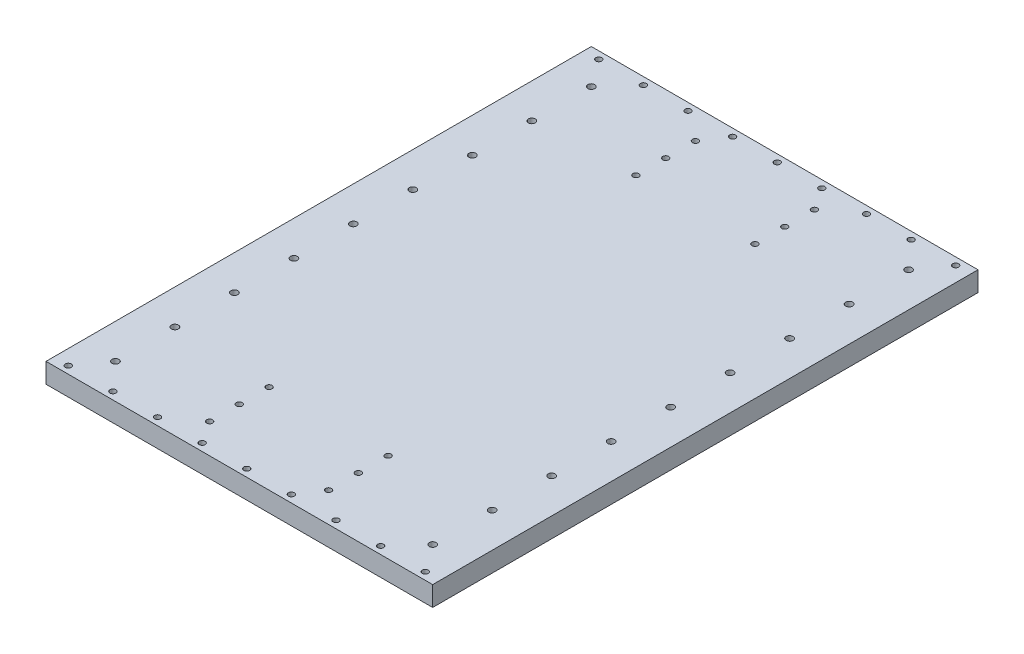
ISO-10303-21;
HEADER;
FILE_DESCRIPTION(('STEP AP214'),'2;1');
FILE_NAME('part.step','',(''),(''),'','','');
FILE_SCHEMA(('AUTOMOTIVE_DESIGN { 1 0 10303 214 1 1 1 1 }'));
ENDSEC;
DATA;
#1=APPLICATION_CONTEXT('core data for automotive mechanical design processes');
#2=APPLICATION_PROTOCOL_DEFINITION('international standard','automotive_design',2000,#1);
#3=PRODUCT_CONTEXT('',#1,'mechanical');
#4=PRODUCT('Part','Part','',(#3));
#5=PRODUCT_RELATED_PRODUCT_CATEGORY('part','',(#4));
#6=PRODUCT_DEFINITION_FORMATION('','',#4);
#7=PRODUCT_DEFINITION_CONTEXT('part definition',#1,'design');
#8=PRODUCT_DEFINITION('design','',#6,#7);
#9=PRODUCT_DEFINITION_SHAPE('','',#8);
#10=(LENGTH_UNIT() NAMED_UNIT(*) SI_UNIT(.MILLI.,.METRE.));
#11=(NAMED_UNIT(*) PLANE_ANGLE_UNIT() SI_UNIT($,.RADIAN.));
#12=(NAMED_UNIT(*) SI_UNIT($,.STERADIAN.) SOLID_ANGLE_UNIT());
#13=UNCERTAINTY_MEASURE_WITH_UNIT(LENGTH_MEASURE(1.E-05),#10,'distance_accuracy_value','');
#14=(GEOMETRIC_REPRESENTATION_CONTEXT(3) GLOBAL_UNCERTAINTY_ASSIGNED_CONTEXT((#13)) GLOBAL_UNIT_ASSIGNED_CONTEXT((#10,
#11,#12)) REPRESENTATION_CONTEXT('',''));
#15=CARTESIAN_POINT('',(0.,0.,0.));
#16=DIRECTION('',(0.,0.,1.));
#17=DIRECTION('',(1.,0.,0.));
#18=AXIS2_PLACEMENT_3D('',#15,#16,#17);
#19=CARTESIAN_POINT('',(-195.,-10.,275.));
#20=DIRECTION('',(-1.,0.,0.));
#21=DIRECTION('',(0.,0.,1.));
#22=AXIS2_PLACEMENT_3D('',#19,#20,#21);
#23=PLANE('',#22);
#24=DIRECTION('',(0.,1.,0.));
#25=VECTOR('',#24,1.);
#26=CARTESIAN_POINT('',(-195.,-10.,275.));
#27=LINE('',#26,#25);
#28=CARTESIAN_POINT('',(-195.,-10.,275.));
#29=VERTEX_POINT('',#28);
#30=CARTESIAN_POINT('',(-195.,10.,275.));
#31=VERTEX_POINT('',#30);
#32=EDGE_CURVE('E35',#29,#31,#27,.T.);
#33=ORIENTED_EDGE('',*,*,#32,.T.);
#34=DIRECTION('',(0.,0.,1.));
#35=VECTOR('',#34,1.);
#36=CARTESIAN_POINT('',(-195.,10.,275.));
#37=LINE('',#36,#35);
#38=CARTESIAN_POINT('',(-195.,10.,-275.));
#39=VERTEX_POINT('',#38);
#40=EDGE_CURVE('E72',#39,#31,#37,.T.);
#41=ORIENTED_EDGE('',*,*,#40,.F.);
#42=DIRECTION('',(0.,1.,0.));
#43=VECTOR('',#42,1.);
#44=CARTESIAN_POINT('',(-195.,-10.,-275.));
#45=LINE('',#44,#43);
#46=CARTESIAN_POINT('',(-195.,-10.,-275.));
#47=VERTEX_POINT('',#46);
#48=EDGE_CURVE('E11',#47,#39,#45,.T.);
#49=ORIENTED_EDGE('',*,*,#48,.F.);
#50=DIRECTION('',(0.,0.,1.));
#51=VECTOR('',#50,1.);
#52=CARTESIAN_POINT('',(-195.,-10.,275.));
#53=LINE('',#52,#51);
#54=EDGE_CURVE('E73',#47,#29,#53,.T.);
#55=ORIENTED_EDGE('',*,*,#54,.T.);
#56=EDGE_LOOP('',(#33,#41,#49,#55));
#57=FACE_BOUND('',#56,.T.);
#58=ADVANCED_FACE('F32',(#57),#23,.T.);
#59=CARTESIAN_POINT('',(-195.,-10.,-275.));
#60=DIRECTION('',(0.,0.,-1.));
#61=DIRECTION('',(-1.,0.,0.));
#62=AXIS2_PLACEMENT_3D('',#59,#60,#61);
#63=PLANE('',#62);
#64=ORIENTED_EDGE('',*,*,#48,.T.);
#65=DIRECTION('',(-1.,0.,0.));
#66=VECTOR('',#65,1.);
#67=CARTESIAN_POINT('',(-195.,10.,-275.));
#68=LINE('',#67,#66);
#69=CARTESIAN_POINT('',(195.,10.,-275.));
#70=VERTEX_POINT('',#69);
#71=EDGE_CURVE('E90',#70,#39,#68,.T.);
#72=ORIENTED_EDGE('',*,*,#71,.F.);
#73=DIRECTION('',(0.,1.,0.));
#74=VECTOR('',#73,1.);
#75=CARTESIAN_POINT('',(195.,-10.,-275.));
#76=LINE('',#75,#74);
#77=CARTESIAN_POINT('',(195.,-10.,-275.));
#78=VERTEX_POINT('',#77);
#79=EDGE_CURVE('E40',#78,#70,#76,.T.);
#80=ORIENTED_EDGE('',*,*,#79,.F.);
#81=DIRECTION('',(-1.,0.,0.));
#82=VECTOR('',#81,1.);
#83=CARTESIAN_POINT('',(-195.,-10.,-275.));
#84=LINE('',#83,#82);
#85=EDGE_CURVE('E78',#78,#47,#84,.T.);
#86=ORIENTED_EDGE('',*,*,#85,.T.);
#87=EDGE_LOOP('',(#64,#72,#80,#86));
#88=FACE_BOUND('',#87,.T.);
#89=ADVANCED_FACE('F254',(#88),#63,.T.);
#90=CARTESIAN_POINT('',(195.,-10.,275.));
#91=DIRECTION('',(1.,0.,0.));
#92=DIRECTION('',(0.,0.,-1.));
#93=AXIS2_PLACEMENT_3D('',#90,#91,#92);
#94=PLANE('',#93);
#95=ORIENTED_EDGE('',*,*,#79,.T.);
#96=DIRECTION('',(0.,0.,-1.));
#97=VECTOR('',#96,1.);
#98=CARTESIAN_POINT('',(195.,10.,275.));
#99=LINE('',#98,#97);
#100=CARTESIAN_POINT('',(195.,10.,275.));
#101=VERTEX_POINT('',#100);
#102=EDGE_CURVE('E85',#101,#70,#99,.T.);
#103=ORIENTED_EDGE('',*,*,#102,.F.);
#104=DIRECTION('',(0.,1.,0.));
#105=VECTOR('',#104,1.);
#106=CARTESIAN_POINT('',(195.,-10.,275.));
#107=LINE('',#106,#105);
#108=CARTESIAN_POINT('',(195.,-10.,275.));
#109=VERTEX_POINT('',#108);
#110=EDGE_CURVE('E77',#109,#101,#107,.T.);
#111=ORIENTED_EDGE('',*,*,#110,.F.);
#112=DIRECTION('',(0.,0.,-1.));
#113=VECTOR('',#112,1.);
#114=CARTESIAN_POINT('',(195.,-10.,275.));
#115=LINE('',#114,#113);
#116=EDGE_CURVE('E247',#109,#78,#115,.T.);
#117=ORIENTED_EDGE('',*,*,#116,.T.);
#118=EDGE_LOOP('',(#95,#103,#111,#117));
#119=FACE_BOUND('',#118,.T.);
#120=ADVANCED_FACE('F251',(#119),#94,.T.);
#121=CARTESIAN_POINT('',(-195.,-10.,275.));
#122=DIRECTION('',(0.,0.,1.));
#123=DIRECTION('',(1.,0.,0.));
#124=AXIS2_PLACEMENT_3D('',#121,#122,#123);
#125=PLANE('',#124);
#126=ORIENTED_EDGE('',*,*,#110,.T.);
#127=DIRECTION('',(1.,0.,0.));
#128=VECTOR('',#127,1.);
#129=CARTESIAN_POINT('',(-195.,10.,275.));
#130=LINE('',#129,#128);
#131=EDGE_CURVE('E80',#31,#101,#130,.T.);
#132=ORIENTED_EDGE('',*,*,#131,.F.);
#133=ORIENTED_EDGE('',*,*,#32,.F.);
#134=DIRECTION('',(1.,0.,0.));
#135=VECTOR('',#134,1.);
#136=CARTESIAN_POINT('',(-195.,-10.,275.));
#137=LINE('',#136,#135);
#138=EDGE_CURVE('E245',#29,#109,#137,.T.);
#139=ORIENTED_EDGE('',*,*,#138,.T.);
#140=EDGE_LOOP('',(#126,#132,#133,#139));
#141=FACE_BOUND('',#140,.T.);
#142=ADVANCED_FACE('F81',(#141),#125,.T.);
#143=CARTESIAN_POINT('',(0.,-10.,0.));
#144=DIRECTION('',(0.,-1.,0.));
#145=DIRECTION('',(0.,0.,-1.));
#146=AXIS2_PLACEMENT_3D('',#143,#144,#145);
#147=PLANE('',#146);
#148=CARTESIAN_POINT('',(60.,-10.,-185.));
#149=DIRECTION('',(0.,1.,0.));
#150=DIRECTION('',(0.,0.,1.));
#151=AXIS2_PLACEMENT_3D('',#148,#149,#150);
#152=CIRCLE('',#151,3.00000000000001);
#153=CARTESIAN_POINT('',(60.,-10.,-182.));
#154=VERTEX_POINT('',#153);
#155=EDGE_CURVE('E100',#154,#154,#152,.T.);
#156=ORIENTED_EDGE('',*,*,#155,.T.);
#157=EDGE_LOOP('',(#156));
#158=FACE_BOUND('',#157,.T.);
#159=CARTESIAN_POINT('',(60.,-10.,-215.));
#160=DIRECTION('',(0.,1.,0.));
#161=DIRECTION('',(0.,0.,1.));
#162=AXIS2_PLACEMENT_3D('',#159,#160,#161);
#163=CIRCLE('',#162,3.00000000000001);
#164=CARTESIAN_POINT('',(60.,-10.,-212.));
#165=VERTEX_POINT('',#164);
#166=EDGE_CURVE('E103',#165,#165,#163,.T.);
#167=ORIENTED_EDGE('',*,*,#166,.T.);
#168=EDGE_LOOP('',(#167));
#169=FACE_BOUND('',#168,.T.);
#170=CARTESIAN_POINT('',(60.,-10.,-245.));
#171=DIRECTION('',(0.,1.,0.));
#172=DIRECTION('',(0.,0.,1.));
#173=AXIS2_PLACEMENT_3D('',#170,#171,#172);
#174=CIRCLE('',#173,3.00000000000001);
#175=CARTESIAN_POINT('',(60.,-10.,-242.));
#176=VERTEX_POINT('',#175);
#177=EDGE_CURVE('E106',#176,#176,#174,.T.);
#178=ORIENTED_EDGE('',*,*,#177,.T.);
#179=EDGE_LOOP('',(#178));
#180=FACE_BOUND('',#179,.T.);
#181=CARTESIAN_POINT('',(60.,-10.,245.));
#182=DIRECTION('',(0.,1.,0.));
#183=DIRECTION('',(0.,0.,1.));
#184=AXIS2_PLACEMENT_3D('',#181,#182,#183);
#185=CIRCLE('',#184,3.00000000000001);
#186=CARTESIAN_POINT('',(60.,-10.,248.));
#187=VERTEX_POINT('',#186);
#188=EDGE_CURVE('E109',#187,#187,#185,.T.);
#189=ORIENTED_EDGE('',*,*,#188,.T.);
#190=EDGE_LOOP('',(#189));
#191=FACE_BOUND('',#190,.T.);
#192=CARTESIAN_POINT('',(60.,-10.,215.));
#193=DIRECTION('',(0.,1.,0.));
#194=DIRECTION('',(0.,0.,1.));
#195=AXIS2_PLACEMENT_3D('',#192,#193,#194);
#196=CIRCLE('',#195,3.00000000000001);
#197=CARTESIAN_POINT('',(60.,-10.,218.));
#198=VERTEX_POINT('',#197);
#199=EDGE_CURVE('E112',#198,#198,#196,.T.);
#200=ORIENTED_EDGE('',*,*,#199,.T.);
#201=EDGE_LOOP('',(#200));
#202=FACE_BOUND('',#201,.T.);
#203=CARTESIAN_POINT('',(60.,-10.,185.));
#204=DIRECTION('',(0.,1.,0.));
#205=DIRECTION('',(0.,0.,1.));
#206=AXIS2_PLACEMENT_3D('',#203,#204,#205);
#207=CIRCLE('',#206,3.00000000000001);
#208=CARTESIAN_POINT('',(60.,-10.,188.));
#209=VERTEX_POINT('',#208);
#210=EDGE_CURVE('E115',#209,#209,#207,.T.);
#211=ORIENTED_EDGE('',*,*,#210,.T.);
#212=EDGE_LOOP('',(#211));
#213=FACE_BOUND('',#212,.T.);
#214=CARTESIAN_POINT('',(-60.,-10.,185.));
#215=DIRECTION('',(0.,1.,0.));
#216=DIRECTION('',(0.,0.,1.));
#217=AXIS2_PLACEMENT_3D('',#214,#215,#216);
#218=CIRCLE('',#217,3.00000000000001);
#219=CARTESIAN_POINT('',(-60.,-10.,188.));
#220=VERTEX_POINT('',#219);
#221=EDGE_CURVE('E118',#220,#220,#218,.T.);
#222=ORIENTED_EDGE('',*,*,#221,.T.);
#223=EDGE_LOOP('',(#222));
#224=FACE_BOUND('',#223,.T.);
#225=CARTESIAN_POINT('',(-60.,-10.,215.));
#226=DIRECTION('',(0.,1.,0.));
#227=DIRECTION('',(0.,0.,1.));
#228=AXIS2_PLACEMENT_3D('',#225,#226,#227);
#229=CIRCLE('',#228,3.00000000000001);
#230=CARTESIAN_POINT('',(-60.,-10.,218.));
#231=VERTEX_POINT('',#230);
#232=EDGE_CURVE('E121',#231,#231,#229,.T.);
#233=ORIENTED_EDGE('',*,*,#232,.T.);
#234=EDGE_LOOP('',(#233));
#235=FACE_BOUND('',#234,.T.);
#236=CARTESIAN_POINT('',(-60.,-10.,245.));
#237=DIRECTION('',(0.,1.,0.));
#238=DIRECTION('',(0.,0.,1.));
#239=AXIS2_PLACEMENT_3D('',#236,#237,#238);
#240=CIRCLE('',#239,3.00000000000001);
#241=CARTESIAN_POINT('',(-60.,-10.,248.));
#242=VERTEX_POINT('',#241);
#243=EDGE_CURVE('E124',#242,#242,#240,.T.);
#244=ORIENTED_EDGE('',*,*,#243,.T.);
#245=EDGE_LOOP('',(#244));
#246=FACE_BOUND('',#245,.T.);
#247=CARTESIAN_POINT('',(-60.,-10.,-185.));
#248=DIRECTION('',(0.,1.,0.));
#249=DIRECTION('',(0.,0.,1.));
#250=AXIS2_PLACEMENT_3D('',#247,#248,#249);
#251=CIRCLE('',#250,3.00000000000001);
#252=CARTESIAN_POINT('',(-60.,-10.,-182.));
#253=VERTEX_POINT('',#252);
#254=EDGE_CURVE('E127',#253,#253,#251,.T.);
#255=ORIENTED_EDGE('',*,*,#254,.T.);
#256=EDGE_LOOP('',(#255));
#257=FACE_BOUND('',#256,.T.);
#258=CARTESIAN_POINT('',(-60.,-10.,-215.));
#259=DIRECTION('',(0.,1.,0.));
#260=DIRECTION('',(0.,0.,1.));
#261=AXIS2_PLACEMENT_3D('',#258,#259,#260);
#262=CIRCLE('',#261,3.00000000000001);
#263=CARTESIAN_POINT('',(-60.,-10.,-212.));
#264=VERTEX_POINT('',#263);
#265=EDGE_CURVE('E130',#264,#264,#262,.T.);
#266=ORIENTED_EDGE('',*,*,#265,.T.);
#267=EDGE_LOOP('',(#266));
#268=FACE_BOUND('',#267,.T.);
#269=CARTESIAN_POINT('',(180.,-10.,-267.5));
#270=DIRECTION('',(0.,1.,0.));
#271=DIRECTION('',(0.,0.,1.));
#272=AXIS2_PLACEMENT_3D('',#269,#270,#271);
#273=CIRCLE('',#272,2.99999999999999);
#274=CARTESIAN_POINT('',(180.,-10.,-264.5));
#275=VERTEX_POINT('',#274);
#276=EDGE_CURVE('E133',#275,#275,#273,.T.);
#277=ORIENTED_EDGE('',*,*,#276,.T.);
#278=EDGE_LOOP('',(#277));
#279=FACE_BOUND('',#278,.T.);
#280=CARTESIAN_POINT('',(135.,-10.,-267.5));
#281=DIRECTION('',(0.,1.,0.));
#282=DIRECTION('',(0.,0.,1.));
#283=AXIS2_PLACEMENT_3D('',#280,#281,#282);
#284=CIRCLE('',#283,2.99999999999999);
#285=CARTESIAN_POINT('',(135.,-10.,-264.5));
#286=VERTEX_POINT('',#285);
#287=EDGE_CURVE('E136',#286,#286,#284,.T.);
#288=ORIENTED_EDGE('',*,*,#287,.T.);
#289=EDGE_LOOP('',(#288));
#290=FACE_BOUND('',#289,.T.);
#291=CARTESIAN_POINT('',(90.,-10.,-267.5));
#292=DIRECTION('',(0.,1.,0.));
#293=DIRECTION('',(0.,0.,1.));
#294=AXIS2_PLACEMENT_3D('',#291,#292,#293);
#295=CIRCLE('',#294,3.00000000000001);
#296=CARTESIAN_POINT('',(90.,-10.,-264.5));
#297=VERTEX_POINT('',#296);
#298=EDGE_CURVE('E139',#297,#297,#295,.T.);
#299=ORIENTED_EDGE('',*,*,#298,.T.);
#300=EDGE_LOOP('',(#299));
#301=FACE_BOUND('',#300,.T.);
#302=CARTESIAN_POINT('',(45.,-10.,-267.5));
#303=DIRECTION('',(0.,1.,0.));
#304=DIRECTION('',(0.,0.,1.));
#305=AXIS2_PLACEMENT_3D('',#302,#303,#304);
#306=CIRCLE('',#305,3.);
#307=CARTESIAN_POINT('',(45.,-10.,-264.5));
#308=VERTEX_POINT('',#307);
#309=EDGE_CURVE('E142',#308,#308,#306,.T.);
#310=ORIENTED_EDGE('',*,*,#309,.T.);
#311=EDGE_LOOP('',(#310));
#312=FACE_BOUND('',#311,.T.);
#313=CARTESIAN_POINT('',(-45.,-10.,-267.5));
#314=DIRECTION('',(0.,1.,0.));
#315=DIRECTION('',(0.,0.,1.));
#316=AXIS2_PLACEMENT_3D('',#313,#314,#315);
#317=CIRCLE('',#316,3.);
#318=CARTESIAN_POINT('',(-45.,-10.,-264.5));
#319=VERTEX_POINT('',#318);
#320=EDGE_CURVE('E145',#319,#319,#317,.T.);
#321=ORIENTED_EDGE('',*,*,#320,.T.);
#322=EDGE_LOOP('',(#321));
#323=FACE_BOUND('',#322,.T.);
#324=CARTESIAN_POINT('',(-90.,-10.,-267.5));
#325=DIRECTION('',(0.,1.,0.));
#326=DIRECTION('',(0.,0.,1.));
#327=AXIS2_PLACEMENT_3D('',#324,#325,#326);
#328=CIRCLE('',#327,3.00000000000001);
#329=CARTESIAN_POINT('',(-90.,-10.,-264.5));
#330=VERTEX_POINT('',#329);
#331=EDGE_CURVE('E148',#330,#330,#328,.T.);
#332=ORIENTED_EDGE('',*,*,#331,.T.);
#333=EDGE_LOOP('',(#332));
#334=FACE_BOUND('',#333,.T.);
#335=CARTESIAN_POINT('',(-135.,-10.,-267.5));
#336=DIRECTION('',(0.,1.,0.));
#337=DIRECTION('',(0.,0.,1.));
#338=AXIS2_PLACEMENT_3D('',#335,#336,#337);
#339=CIRCLE('',#338,2.99999999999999);
#340=CARTESIAN_POINT('',(-135.,-10.,-264.5));
#341=VERTEX_POINT('',#340);
#342=EDGE_CURVE('E151',#341,#341,#339,.T.);
#343=ORIENTED_EDGE('',*,*,#342,.T.);
#344=EDGE_LOOP('',(#343));
#345=FACE_BOUND('',#344,.T.);
#346=CARTESIAN_POINT('',(-180.,-10.,-267.5));
#347=DIRECTION('',(0.,1.,0.));
#348=DIRECTION('',(0.,0.,1.));
#349=AXIS2_PLACEMENT_3D('',#346,#347,#348);
#350=CIRCLE('',#349,2.99999999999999);
#351=CARTESIAN_POINT('',(-180.,-10.,-264.5));
#352=VERTEX_POINT('',#351);
#353=EDGE_CURVE('E154',#352,#352,#350,.T.);
#354=ORIENTED_EDGE('',*,*,#353,.T.);
#355=EDGE_LOOP('',(#354));
#356=FACE_BOUND('',#355,.T.);
#357=CARTESIAN_POINT('',(180.,-10.,267.5));
#358=DIRECTION('',(0.,1.,0.));
#359=DIRECTION('',(0.,0.,1.));
#360=AXIS2_PLACEMENT_3D('',#357,#358,#359);
#361=CIRCLE('',#360,2.99999999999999);
#362=CARTESIAN_POINT('',(180.,-10.,270.5));
#363=VERTEX_POINT('',#362);
#364=EDGE_CURVE('E157',#363,#363,#361,.T.);
#365=ORIENTED_EDGE('',*,*,#364,.T.);
#366=EDGE_LOOP('',(#365));
#367=FACE_BOUND('',#366,.T.);
#368=CARTESIAN_POINT('',(135.,-10.,267.5));
#369=DIRECTION('',(0.,1.,0.));
#370=DIRECTION('',(0.,0.,1.));
#371=AXIS2_PLACEMENT_3D('',#368,#369,#370);
#372=CIRCLE('',#371,2.99999999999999);
#373=CARTESIAN_POINT('',(135.,-10.,270.5));
#374=VERTEX_POINT('',#373);
#375=EDGE_CURVE('E160',#374,#374,#372,.T.);
#376=ORIENTED_EDGE('',*,*,#375,.T.);
#377=EDGE_LOOP('',(#376));
#378=FACE_BOUND('',#377,.T.);
#379=CARTESIAN_POINT('',(90.,-10.,267.5));
#380=DIRECTION('',(0.,1.,0.));
#381=DIRECTION('',(0.,0.,1.));
#382=AXIS2_PLACEMENT_3D('',#379,#380,#381);
#383=CIRCLE('',#382,3.00000000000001);
#384=CARTESIAN_POINT('',(90.,-10.,270.5));
#385=VERTEX_POINT('',#384);
#386=EDGE_CURVE('E163',#385,#385,#383,.T.);
#387=ORIENTED_EDGE('',*,*,#386,.T.);
#388=EDGE_LOOP('',(#387));
#389=FACE_BOUND('',#388,.T.);
#390=CARTESIAN_POINT('',(45.,-10.,267.5));
#391=DIRECTION('',(0.,1.,0.));
#392=DIRECTION('',(0.,0.,1.));
#393=AXIS2_PLACEMENT_3D('',#390,#391,#392);
#394=CIRCLE('',#393,3.);
#395=CARTESIAN_POINT('',(45.,-10.,270.5));
#396=VERTEX_POINT('',#395);
#397=EDGE_CURVE('E166',#396,#396,#394,.T.);
#398=ORIENTED_EDGE('',*,*,#397,.T.);
#399=EDGE_LOOP('',(#398));
#400=FACE_BOUND('',#399,.T.);
#401=CARTESIAN_POINT('',(0.,-10.,267.5));
#402=DIRECTION('',(0.,1.,0.));
#403=DIRECTION('',(0.,0.,1.));
#404=AXIS2_PLACEMENT_3D('',#401,#402,#403);
#405=CIRCLE('',#404,3.);
#406=CARTESIAN_POINT('',(0.,-10.,270.5));
#407=VERTEX_POINT('',#406);
#408=EDGE_CURVE('E169',#407,#407,#405,.T.);
#409=ORIENTED_EDGE('',*,*,#408,.T.);
#410=EDGE_LOOP('',(#409));
#411=FACE_BOUND('',#410,.T.);
#412=CARTESIAN_POINT('',(-45.,-10.,267.5));
#413=DIRECTION('',(0.,1.,0.));
#414=DIRECTION('',(0.,0.,1.));
#415=AXIS2_PLACEMENT_3D('',#412,#413,#414);
#416=CIRCLE('',#415,3.);
#417=CARTESIAN_POINT('',(-45.,-10.,270.5));
#418=VERTEX_POINT('',#417);
#419=EDGE_CURVE('E172',#418,#418,#416,.T.);
#420=ORIENTED_EDGE('',*,*,#419,.T.);
#421=EDGE_LOOP('',(#420));
#422=FACE_BOUND('',#421,.T.);
#423=CARTESIAN_POINT('',(-90.,-10.,267.5));
#424=DIRECTION('',(0.,1.,0.));
#425=DIRECTION('',(0.,0.,1.));
#426=AXIS2_PLACEMENT_3D('',#423,#424,#425);
#427=CIRCLE('',#426,3.00000000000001);
#428=CARTESIAN_POINT('',(-90.,-10.,270.5));
#429=VERTEX_POINT('',#428);
#430=EDGE_CURVE('E175',#429,#429,#427,.T.);
#431=ORIENTED_EDGE('',*,*,#430,.T.);
#432=EDGE_LOOP('',(#431));
#433=FACE_BOUND('',#432,.T.);
#434=CARTESIAN_POINT('',(-135.,-10.,267.5));
#435=DIRECTION('',(0.,1.,0.));
#436=DIRECTION('',(0.,0.,1.));
#437=AXIS2_PLACEMENT_3D('',#434,#435,#436);
#438=CIRCLE('',#437,2.99999999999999);
#439=CARTESIAN_POINT('',(-135.,-10.,270.5));
#440=VERTEX_POINT('',#439);
#441=EDGE_CURVE('E178',#440,#440,#438,.T.);
#442=ORIENTED_EDGE('',*,*,#441,.T.);
#443=EDGE_LOOP('',(#442));
#444=FACE_BOUND('',#443,.T.);
#445=CARTESIAN_POINT('',(-180.,-10.,267.5));
#446=DIRECTION('',(0.,1.,0.));
#447=DIRECTION('',(0.,0.,1.));
#448=AXIS2_PLACEMENT_3D('',#445,#446,#447);
#449=CIRCLE('',#448,2.99999999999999);
#450=CARTESIAN_POINT('',(-180.,-10.,270.5));
#451=VERTEX_POINT('',#450);
#452=EDGE_CURVE('E181',#451,#451,#449,.T.);
#453=ORIENTED_EDGE('',*,*,#452,.T.);
#454=EDGE_LOOP('',(#453));
#455=FACE_BOUND('',#454,.T.);
#456=CARTESIAN_POINT('',(0.,-10.,-267.5));
#457=DIRECTION('',(0.,1.,0.));
#458=DIRECTION('',(0.,0.,1.));
#459=AXIS2_PLACEMENT_3D('',#456,#457,#458);
#460=CIRCLE('',#459,3.);
#461=CARTESIAN_POINT('',(0.,-10.,-264.5));
#462=VERTEX_POINT('',#461);
#463=EDGE_CURVE('E184',#462,#462,#460,.T.);
#464=ORIENTED_EDGE('',*,*,#463,.T.);
#465=EDGE_LOOP('',(#464));
#466=FACE_BOUND('',#465,.T.);
#467=CARTESIAN_POINT('',(-60.,-10.,-245.));
#468=DIRECTION('',(0.,1.,0.));
#469=DIRECTION('',(0.,0.,1.));
#470=AXIS2_PLACEMENT_3D('',#467,#468,#469);
#471=CIRCLE('',#470,3.00000000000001);
#472=CARTESIAN_POINT('',(-60.,-10.,-242.));
#473=VERTEX_POINT('',#472);
#474=EDGE_CURVE('E187',#473,#473,#471,.T.);
#475=ORIENTED_EDGE('',*,*,#474,.T.);
#476=EDGE_LOOP('',(#475));
#477=FACE_BOUND('',#476,.T.);
#478=CARTESIAN_POINT('',(-160.,-10.,240.));
#479=DIRECTION('',(0.,1.,0.));
#480=DIRECTION('',(0.,0.,1.));
#481=AXIS2_PLACEMENT_3D('',#478,#479,#480);
#482=CIRCLE('',#481,3.49999999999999);
#483=CARTESIAN_POINT('',(-160.,-10.,243.5));
#484=VERTEX_POINT('',#483);
#485=EDGE_CURVE('E190',#484,#484,#482,.T.);
#486=ORIENTED_EDGE('',*,*,#485,.T.);
#487=EDGE_LOOP('',(#486));
#488=FACE_BOUND('',#487,.T.);
#489=CARTESIAN_POINT('',(-160.,-10.,180.));
#490=DIRECTION('',(0.,1.,0.));
#491=DIRECTION('',(0.,0.,1.));
#492=AXIS2_PLACEMENT_3D('',#489,#490,#491);
#493=CIRCLE('',#492,3.49999999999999);
#494=CARTESIAN_POINT('',(-160.,-10.,183.5));
#495=VERTEX_POINT('',#494);
#496=EDGE_CURVE('E193',#495,#495,#493,.T.);
#497=ORIENTED_EDGE('',*,*,#496,.T.);
#498=EDGE_LOOP('',(#497));
#499=FACE_BOUND('',#498,.T.);
#500=CARTESIAN_POINT('',(-160.,-10.,120.));
#501=DIRECTION('',(0.,1.,0.));
#502=DIRECTION('',(0.,0.,1.));
#503=AXIS2_PLACEMENT_3D('',#500,#501,#502);
#504=CIRCLE('',#503,3.49999999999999);
#505=CARTESIAN_POINT('',(-160.,-10.,123.5));
#506=VERTEX_POINT('',#505);
#507=EDGE_CURVE('E196',#506,#506,#504,.T.);
#508=ORIENTED_EDGE('',*,*,#507,.T.);
#509=EDGE_LOOP('',(#508));
#510=FACE_BOUND('',#509,.T.);
#511=CARTESIAN_POINT('',(-160.,-10.,60.));
#512=DIRECTION('',(0.,1.,0.));
#513=DIRECTION('',(0.,0.,1.));
#514=AXIS2_PLACEMENT_3D('',#511,#512,#513);
#515=CIRCLE('',#514,3.49999999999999);
#516=CARTESIAN_POINT('',(-160.,-10.,63.5));
#517=VERTEX_POINT('',#516);
#518=EDGE_CURVE('E199',#517,#517,#515,.T.);
#519=ORIENTED_EDGE('',*,*,#518,.T.);
#520=EDGE_LOOP('',(#519));
#521=FACE_BOUND('',#520,.T.);
#522=CARTESIAN_POINT('',(-160.,-10.,0.));
#523=DIRECTION('',(0.,1.,0.));
#524=DIRECTION('',(0.,0.,1.));
#525=AXIS2_PLACEMENT_3D('',#522,#523,#524);
#526=CIRCLE('',#525,3.49999999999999);
#527=CARTESIAN_POINT('',(-160.,-10.,3.49999999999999));
#528=VERTEX_POINT('',#527);
#529=EDGE_CURVE('E202',#528,#528,#526,.T.);
#530=ORIENTED_EDGE('',*,*,#529,.T.);
#531=EDGE_LOOP('',(#530));
#532=FACE_BOUND('',#531,.T.);
#533=CARTESIAN_POINT('',(-160.,-10.,-60.));
#534=DIRECTION('',(0.,1.,0.));
#535=DIRECTION('',(0.,0.,1.));
#536=AXIS2_PLACEMENT_3D('',#533,#534,#535);
#537=CIRCLE('',#536,3.49999999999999);
#538=CARTESIAN_POINT('',(-160.,-10.,-56.5));
#539=VERTEX_POINT('',#538);
#540=EDGE_CURVE('E205',#539,#539,#537,.T.);
#541=ORIENTED_EDGE('',*,*,#540,.T.);
#542=EDGE_LOOP('',(#541));
#543=FACE_BOUND('',#542,.T.);
#544=CARTESIAN_POINT('',(-160.,-10.,-120.));
#545=DIRECTION('',(0.,1.,0.));
#546=DIRECTION('',(0.,0.,1.));
#547=AXIS2_PLACEMENT_3D('',#544,#545,#546);
#548=CIRCLE('',#547,3.49999999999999);
#549=CARTESIAN_POINT('',(-160.,-10.,-116.5));
#550=VERTEX_POINT('',#549);
#551=EDGE_CURVE('E208',#550,#550,#548,.T.);
#552=ORIENTED_EDGE('',*,*,#551,.T.);
#553=EDGE_LOOP('',(#552));
#554=FACE_BOUND('',#553,.T.);
#555=CARTESIAN_POINT('',(-160.,-10.,-180.));
#556=DIRECTION('',(0.,1.,0.));
#557=DIRECTION('',(0.,0.,1.));
#558=AXIS2_PLACEMENT_3D('',#555,#556,#557);
#559=CIRCLE('',#558,3.49999999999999);
#560=CARTESIAN_POINT('',(-160.,-10.,-176.5));
#561=VERTEX_POINT('',#560);
#562=EDGE_CURVE('E211',#561,#561,#559,.T.);
#563=ORIENTED_EDGE('',*,*,#562,.T.);
#564=EDGE_LOOP('',(#563));
#565=FACE_BOUND('',#564,.T.);
#566=CARTESIAN_POINT('',(-160.,-10.,-240.));
#567=DIRECTION('',(0.,1.,0.));
#568=DIRECTION('',(0.,0.,1.));
#569=AXIS2_PLACEMENT_3D('',#566,#567,#568);
#570=CIRCLE('',#569,3.49999999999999);
#571=CARTESIAN_POINT('',(-160.,-10.,-236.5));
#572=VERTEX_POINT('',#571);
#573=EDGE_CURVE('E214',#572,#572,#570,.T.);
#574=ORIENTED_EDGE('',*,*,#573,.T.);
#575=EDGE_LOOP('',(#574));
#576=FACE_BOUND('',#575,.T.);
#577=CARTESIAN_POINT('',(160.,-10.,240.));
#578=DIRECTION('',(0.,1.,0.));
#579=DIRECTION('',(0.,0.,1.));
#580=AXIS2_PLACEMENT_3D('',#577,#578,#579);
#581=CIRCLE('',#580,3.49999999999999);
#582=CARTESIAN_POINT('',(160.,-10.,243.5));
#583=VERTEX_POINT('',#582);
#584=EDGE_CURVE('E217',#583,#583,#581,.T.);
#585=ORIENTED_EDGE('',*,*,#584,.T.);
#586=EDGE_LOOP('',(#585));
#587=FACE_BOUND('',#586,.T.);
#588=CARTESIAN_POINT('',(160.,-10.,180.));
#589=DIRECTION('',(0.,1.,0.));
#590=DIRECTION('',(0.,0.,1.));
#591=AXIS2_PLACEMENT_3D('',#588,#589,#590);
#592=CIRCLE('',#591,3.49999999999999);
#593=CARTESIAN_POINT('',(160.,-10.,183.5));
#594=VERTEX_POINT('',#593);
#595=EDGE_CURVE('E220',#594,#594,#592,.T.);
#596=ORIENTED_EDGE('',*,*,#595,.T.);
#597=EDGE_LOOP('',(#596));
#598=FACE_BOUND('',#597,.T.);
#599=CARTESIAN_POINT('',(160.,-10.,120.));
#600=DIRECTION('',(0.,1.,0.));
#601=DIRECTION('',(0.,0.,1.));
#602=AXIS2_PLACEMENT_3D('',#599,#600,#601);
#603=CIRCLE('',#602,3.49999999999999);
#604=CARTESIAN_POINT('',(160.,-10.,123.5));
#605=VERTEX_POINT('',#604);
#606=EDGE_CURVE('E223',#605,#605,#603,.T.);
#607=ORIENTED_EDGE('',*,*,#606,.T.);
#608=EDGE_LOOP('',(#607));
#609=FACE_BOUND('',#608,.T.);
#610=CARTESIAN_POINT('',(160.,-10.,60.));
#611=DIRECTION('',(0.,1.,0.));
#612=DIRECTION('',(0.,0.,1.));
#613=AXIS2_PLACEMENT_3D('',#610,#611,#612);
#614=CIRCLE('',#613,3.49999999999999);
#615=CARTESIAN_POINT('',(160.,-10.,63.5));
#616=VERTEX_POINT('',#615);
#617=EDGE_CURVE('E226',#616,#616,#614,.T.);
#618=ORIENTED_EDGE('',*,*,#617,.T.);
#619=EDGE_LOOP('',(#618));
#620=FACE_BOUND('',#619,.T.);
#621=CARTESIAN_POINT('',(160.,-10.,-60.));
#622=DIRECTION('',(0.,1.,0.));
#623=DIRECTION('',(0.,0.,1.));
#624=AXIS2_PLACEMENT_3D('',#621,#622,#623);
#625=CIRCLE('',#624,3.49999999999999);
#626=CARTESIAN_POINT('',(160.,-10.,-56.5));
#627=VERTEX_POINT('',#626);
#628=EDGE_CURVE('E229',#627,#627,#625,.T.);
#629=ORIENTED_EDGE('',*,*,#628,.T.);
#630=EDGE_LOOP('',(#629));
#631=FACE_BOUND('',#630,.T.);
#632=CARTESIAN_POINT('',(160.,-10.,-120.));
#633=DIRECTION('',(0.,1.,0.));
#634=DIRECTION('',(0.,0.,1.));
#635=AXIS2_PLACEMENT_3D('',#632,#633,#634);
#636=CIRCLE('',#635,3.49999999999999);
#637=CARTESIAN_POINT('',(160.,-10.,-116.5));
#638=VERTEX_POINT('',#637);
#639=EDGE_CURVE('E232',#638,#638,#636,.T.);
#640=ORIENTED_EDGE('',*,*,#639,.T.);
#641=EDGE_LOOP('',(#640));
#642=FACE_BOUND('',#641,.T.);
#643=CARTESIAN_POINT('',(160.,-10.,-180.));
#644=DIRECTION('',(0.,1.,0.));
#645=DIRECTION('',(0.,0.,1.));
#646=AXIS2_PLACEMENT_3D('',#643,#644,#645);
#647=CIRCLE('',#646,3.49999999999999);
#648=CARTESIAN_POINT('',(160.,-10.,-176.5));
#649=VERTEX_POINT('',#648);
#650=EDGE_CURVE('E235',#649,#649,#647,.T.);
#651=ORIENTED_EDGE('',*,*,#650,.T.);
#652=EDGE_LOOP('',(#651));
#653=FACE_BOUND('',#652,.T.);
#654=CARTESIAN_POINT('',(160.,-10.,-240.));
#655=DIRECTION('',(0.,1.,0.));
#656=DIRECTION('',(0.,0.,1.));
#657=AXIS2_PLACEMENT_3D('',#654,#655,#656);
#658=CIRCLE('',#657,3.49999999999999);
#659=CARTESIAN_POINT('',(160.,-10.,-236.5));
#660=VERTEX_POINT('',#659);
#661=EDGE_CURVE('E238',#660,#660,#658,.T.);
#662=ORIENTED_EDGE('',*,*,#661,.T.);
#663=EDGE_LOOP('',(#662));
#664=FACE_BOUND('',#663,.T.);
#665=CARTESIAN_POINT('',(160.,-10.,0.));
#666=DIRECTION('',(0.,1.,0.));
#667=DIRECTION('',(0.,0.,1.));
#668=AXIS2_PLACEMENT_3D('',#665,#666,#667);
#669=CIRCLE('',#668,3.49999999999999);
#670=CARTESIAN_POINT('',(160.,-10.,3.49999999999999));
#671=VERTEX_POINT('',#670);
#672=EDGE_CURVE('E241',#671,#671,#669,.T.);
#673=ORIENTED_EDGE('',*,*,#672,.T.);
#674=EDGE_LOOP('',(#673));
#675=FACE_BOUND('',#674,.T.);
#676=ORIENTED_EDGE('',*,*,#54,.F.);
#677=ORIENTED_EDGE('',*,*,#85,.F.);
#678=ORIENTED_EDGE('',*,*,#116,.F.);
#679=ORIENTED_EDGE('',*,*,#138,.F.);
#680=EDGE_LOOP('',(#676,#677,#678,#679));
#681=FACE_BOUND('',#680,.T.);
#682=ADVANCED_FACE('F256',(#158,#169,#180,#191,#202,#213,#224,#235,#246,#257,#268,#279,#290,
#301,#312,#323,#334,#345,#356,#367,#378,#389,#400,#411,#422,#433,#444,#455,#466,#477,#488,#499,
#510,#521,#532,#543,#554,#565,#576,#587,#598,#609,#620,#631,#642,#653,#664,#675,#681),#147,.T.);
#683=CARTESIAN_POINT('',(160.,-10.,0.));
#684=DIRECTION('',(0.,1.,0.));
#685=DIRECTION('',(0.,0.,1.));
#686=AXIS2_PLACEMENT_3D('',#683,#684,#685);
#687=CYLINDRICAL_SURFACE('',#686,3.49999999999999);
#688=ORIENTED_EDGE('',*,*,#672,.F.);
#689=EDGE_LOOP('',(#688));
#690=FACE_BOUND('',#689,.T.);
#691=CARTESIAN_POINT('',(160.,10.,0.));
#692=DIRECTION('',(0.,1.,0.));
#693=DIRECTION('',(0.,0.,1.));
#694=AXIS2_PLACEMENT_3D('',#691,#692,#693);
#695=CIRCLE('',#694,3.49999999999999);
#696=CARTESIAN_POINT('',(160.,10.,3.49999999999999));
#697=VERTEX_POINT('',#696);
#698=EDGE_CURVE('E91',#697,#697,#695,.T.);
#699=ORIENTED_EDGE('',*,*,#698,.T.);
#700=EDGE_LOOP('',(#699));
#701=FACE_BOUND('',#700,.T.);
#702=ADVANCED_FACE('F258',(#690,#701),#687,.F.);
#703=CARTESIAN_POINT('',(160.,-10.,-240.));
#704=DIRECTION('',(0.,1.,0.));
#705=DIRECTION('',(0.,0.,1.));
#706=AXIS2_PLACEMENT_3D('',#703,#704,#705);
#707=CYLINDRICAL_SURFACE('',#706,3.49999999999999);
#708=ORIENTED_EDGE('',*,*,#661,.F.);
#709=EDGE_LOOP('',(#708));
#710=FACE_BOUND('',#709,.T.);
#711=CARTESIAN_POINT('',(160.,10.,-240.));
#712=DIRECTION('',(0.,1.,0.));
#713=DIRECTION('',(0.,0.,1.));
#714=AXIS2_PLACEMENT_3D('',#711,#712,#713);
#715=CIRCLE('',#714,3.49999999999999);
#716=CARTESIAN_POINT('',(160.,10.,-236.5));
#717=VERTEX_POINT('',#716);
#718=EDGE_CURVE('E94',#717,#717,#715,.T.);
#719=ORIENTED_EDGE('',*,*,#718,.T.);
#720=EDGE_LOOP('',(#719));
#721=FACE_BOUND('',#720,.T.);
#722=ADVANCED_FACE('F265',(#710,#721),#707,.F.);
#723=CARTESIAN_POINT('',(160.,-10.,-180.));
#724=DIRECTION('',(0.,1.,0.));
#725=DIRECTION('',(0.,0.,1.));
#726=AXIS2_PLACEMENT_3D('',#723,#724,#725);
#727=CYLINDRICAL_SURFACE('',#726,3.49999999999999);
#728=ORIENTED_EDGE('',*,*,#650,.F.);
#729=EDGE_LOOP('',(#728));
#730=FACE_BOUND('',#729,.T.);
#731=CARTESIAN_POINT('',(160.,10.,-180.));
#732=DIRECTION('',(0.,1.,0.));
#733=DIRECTION('',(0.,0.,1.));
#734=AXIS2_PLACEMENT_3D('',#731,#732,#733);
#735=CIRCLE('',#734,3.49999999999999);
#736=CARTESIAN_POINT('',(160.,10.,-176.5));
#737=VERTEX_POINT('',#736);
#738=EDGE_CURVE('E915',#737,#737,#735,.T.);
#739=ORIENTED_EDGE('',*,*,#738,.T.);
#740=EDGE_LOOP('',(#739));
#741=FACE_BOUND('',#740,.T.);
#742=ADVANCED_FACE('F303',(#730,#741),#727,.F.);
#743=CARTESIAN_POINT('',(160.,-10.,-120.));
#744=DIRECTION('',(0.,1.,0.));
#745=DIRECTION('',(0.,0.,1.));
#746=AXIS2_PLACEMENT_3D('',#743,#744,#745);
#747=CYLINDRICAL_SURFACE('',#746,3.49999999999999);
#748=ORIENTED_EDGE('',*,*,#639,.F.);
#749=EDGE_LOOP('',(#748));
#750=FACE_BOUND('',#749,.T.);
#751=CARTESIAN_POINT('',(160.,10.,-120.));
#752=DIRECTION('',(0.,1.,0.));
#753=DIRECTION('',(0.,0.,1.));
#754=AXIS2_PLACEMENT_3D('',#751,#752,#753);
#755=CIRCLE('',#754,3.49999999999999);
#756=CARTESIAN_POINT('',(160.,10.,-116.5));
#757=VERTEX_POINT('',#756);
#758=EDGE_CURVE('E912',#757,#757,#755,.T.);
#759=ORIENTED_EDGE('',*,*,#758,.T.);
#760=EDGE_LOOP('',(#759));
#761=FACE_BOUND('',#760,.T.);
#762=ADVANCED_FACE('F313',(#750,#761),#747,.F.);
#763=CARTESIAN_POINT('',(160.,-10.,-60.));
#764=DIRECTION('',(0.,1.,0.));
#765=DIRECTION('',(0.,0.,1.));
#766=AXIS2_PLACEMENT_3D('',#763,#764,#765);
#767=CYLINDRICAL_SURFACE('',#766,3.49999999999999);
#768=ORIENTED_EDGE('',*,*,#628,.F.);
#769=EDGE_LOOP('',(#768));
#770=FACE_BOUND('',#769,.T.);
#771=CARTESIAN_POINT('',(160.,10.,-60.));
#772=DIRECTION('',(0.,1.,0.));
#773=DIRECTION('',(0.,0.,1.));
#774=AXIS2_PLACEMENT_3D('',#771,#772,#773);
#775=CIRCLE('',#774,3.49999999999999);
#776=CARTESIAN_POINT('',(160.,10.,-56.5));
#777=VERTEX_POINT('',#776);
#778=EDGE_CURVE('E909',#777,#777,#775,.T.);
#779=ORIENTED_EDGE('',*,*,#778,.T.);
#780=EDGE_LOOP('',(#779));
#781=FACE_BOUND('',#780,.T.);
#782=ADVANCED_FACE('F323',(#770,#781),#767,.F.);
#783=CARTESIAN_POINT('',(160.,-10.,60.));
#784=DIRECTION('',(0.,1.,0.));
#785=DIRECTION('',(0.,0.,1.));
#786=AXIS2_PLACEMENT_3D('',#783,#784,#785);
#787=CYLINDRICAL_SURFACE('',#786,3.49999999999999);
#788=ORIENTED_EDGE('',*,*,#617,.F.);
#789=EDGE_LOOP('',(#788));
#790=FACE_BOUND('',#789,.T.);
#791=CARTESIAN_POINT('',(160.,10.,60.));
#792=DIRECTION('',(0.,1.,0.));
#793=DIRECTION('',(0.,0.,1.));
#794=AXIS2_PLACEMENT_3D('',#791,#792,#793);
#795=CIRCLE('',#794,3.49999999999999);
#796=CARTESIAN_POINT('',(160.,10.,63.5));
#797=VERTEX_POINT('',#796);
#798=EDGE_CURVE('E906',#797,#797,#795,.T.);
#799=ORIENTED_EDGE('',*,*,#798,.T.);
#800=EDGE_LOOP('',(#799));
#801=FACE_BOUND('',#800,.T.);
#802=ADVANCED_FACE('F333',(#790,#801),#787,.F.);
#803=CARTESIAN_POINT('',(160.,-10.,120.));
#804=DIRECTION('',(0.,1.,0.));
#805=DIRECTION('',(0.,0.,1.));
#806=AXIS2_PLACEMENT_3D('',#803,#804,#805);
#807=CYLINDRICAL_SURFACE('',#806,3.49999999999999);
#808=ORIENTED_EDGE('',*,*,#606,.F.);
#809=EDGE_LOOP('',(#808));
#810=FACE_BOUND('',#809,.T.);
#811=CARTESIAN_POINT('',(160.,10.,120.));
#812=DIRECTION('',(0.,1.,0.));
#813=DIRECTION('',(0.,0.,1.));
#814=AXIS2_PLACEMENT_3D('',#811,#812,#813);
#815=CIRCLE('',#814,3.49999999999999);
#816=CARTESIAN_POINT('',(160.,10.,123.5));
#817=VERTEX_POINT('',#816);
#818=EDGE_CURVE('E903',#817,#817,#815,.T.);
#819=ORIENTED_EDGE('',*,*,#818,.T.);
#820=EDGE_LOOP('',(#819));
#821=FACE_BOUND('',#820,.T.);
#822=ADVANCED_FACE('F343',(#810,#821),#807,.F.);
#823=CARTESIAN_POINT('',(160.,-10.,180.));
#824=DIRECTION('',(0.,1.,0.));
#825=DIRECTION('',(0.,0.,1.));
#826=AXIS2_PLACEMENT_3D('',#823,#824,#825);
#827=CYLINDRICAL_SURFACE('',#826,3.49999999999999);
#828=ORIENTED_EDGE('',*,*,#595,.F.);
#829=EDGE_LOOP('',(#828));
#830=FACE_BOUND('',#829,.T.);
#831=CARTESIAN_POINT('',(160.,10.,180.));
#832=DIRECTION('',(0.,1.,0.));
#833=DIRECTION('',(0.,0.,1.));
#834=AXIS2_PLACEMENT_3D('',#831,#832,#833);
#835=CIRCLE('',#834,3.49999999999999);
#836=CARTESIAN_POINT('',(160.,10.,183.5));
#837=VERTEX_POINT('',#836);
#838=EDGE_CURVE('E900',#837,#837,#835,.T.);
#839=ORIENTED_EDGE('',*,*,#838,.T.);
#840=EDGE_LOOP('',(#839));
#841=FACE_BOUND('',#840,.T.);
#842=ADVANCED_FACE('F353',(#830,#841),#827,.F.);
#843=CARTESIAN_POINT('',(160.,-10.,240.));
#844=DIRECTION('',(0.,1.,0.));
#845=DIRECTION('',(0.,0.,1.));
#846=AXIS2_PLACEMENT_3D('',#843,#844,#845);
#847=CYLINDRICAL_SURFACE('',#846,3.49999999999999);
#848=ORIENTED_EDGE('',*,*,#584,.F.);
#849=EDGE_LOOP('',(#848));
#850=FACE_BOUND('',#849,.T.);
#851=CARTESIAN_POINT('',(160.,10.,240.));
#852=DIRECTION('',(0.,1.,0.));
#853=DIRECTION('',(0.,0.,1.));
#854=AXIS2_PLACEMENT_3D('',#851,#852,#853);
#855=CIRCLE('',#854,3.49999999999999);
#856=CARTESIAN_POINT('',(160.,10.,243.5));
#857=VERTEX_POINT('',#856);
#858=EDGE_CURVE('E897',#857,#857,#855,.T.);
#859=ORIENTED_EDGE('',*,*,#858,.T.);
#860=EDGE_LOOP('',(#859));
#861=FACE_BOUND('',#860,.T.);
#862=ADVANCED_FACE('F363',(#850,#861),#847,.F.);
#863=CARTESIAN_POINT('',(-160.,-10.,-240.));
#864=DIRECTION('',(0.,1.,0.));
#865=DIRECTION('',(0.,0.,1.));
#866=AXIS2_PLACEMENT_3D('',#863,#864,#865);
#867=CYLINDRICAL_SURFACE('',#866,3.49999999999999);
#868=ORIENTED_EDGE('',*,*,#573,.F.);
#869=EDGE_LOOP('',(#868));
#870=FACE_BOUND('',#869,.T.);
#871=CARTESIAN_POINT('',(-160.,10.,-240.));
#872=DIRECTION('',(0.,1.,0.));
#873=DIRECTION('',(0.,0.,1.));
#874=AXIS2_PLACEMENT_3D('',#871,#872,#873);
#875=CIRCLE('',#874,3.49999999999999);
#876=CARTESIAN_POINT('',(-160.,10.,-236.5));
#877=VERTEX_POINT('',#876);
#878=EDGE_CURVE('E894',#877,#877,#875,.T.);
#879=ORIENTED_EDGE('',*,*,#878,.T.);
#880=EDGE_LOOP('',(#879));
#881=FACE_BOUND('',#880,.T.);
#882=ADVANCED_FACE('F373',(#870,#881),#867,.F.);
#883=CARTESIAN_POINT('',(-160.,-10.,-180.));
#884=DIRECTION('',(0.,1.,0.));
#885=DIRECTION('',(0.,0.,1.));
#886=AXIS2_PLACEMENT_3D('',#883,#884,#885);
#887=CYLINDRICAL_SURFACE('',#886,3.49999999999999);
#888=ORIENTED_EDGE('',*,*,#562,.F.);
#889=EDGE_LOOP('',(#888));
#890=FACE_BOUND('',#889,.T.);
#891=CARTESIAN_POINT('',(-160.,10.,-180.));
#892=DIRECTION('',(0.,1.,0.));
#893=DIRECTION('',(0.,0.,1.));
#894=AXIS2_PLACEMENT_3D('',#891,#892,#893);
#895=CIRCLE('',#894,3.49999999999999);
#896=CARTESIAN_POINT('',(-160.,10.,-176.5));
#897=VERTEX_POINT('',#896);
#898=EDGE_CURVE('E891',#897,#897,#895,.T.);
#899=ORIENTED_EDGE('',*,*,#898,.T.);
#900=EDGE_LOOP('',(#899));
#901=FACE_BOUND('',#900,.T.);
#902=ADVANCED_FACE('F383',(#890,#901),#887,.F.);
#903=CARTESIAN_POINT('',(-160.,-10.,-120.));
#904=DIRECTION('',(0.,1.,0.));
#905=DIRECTION('',(0.,0.,1.));
#906=AXIS2_PLACEMENT_3D('',#903,#904,#905);
#907=CYLINDRICAL_SURFACE('',#906,3.49999999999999);
#908=ORIENTED_EDGE('',*,*,#551,.F.);
#909=EDGE_LOOP('',(#908));
#910=FACE_BOUND('',#909,.T.);
#911=CARTESIAN_POINT('',(-160.,10.,-120.));
#912=DIRECTION('',(0.,1.,0.));
#913=DIRECTION('',(0.,0.,1.));
#914=AXIS2_PLACEMENT_3D('',#911,#912,#913);
#915=CIRCLE('',#914,3.49999999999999);
#916=CARTESIAN_POINT('',(-160.,10.,-116.5));
#917=VERTEX_POINT('',#916);
#918=EDGE_CURVE('E888',#917,#917,#915,.T.);
#919=ORIENTED_EDGE('',*,*,#918,.T.);
#920=EDGE_LOOP('',(#919));
#921=FACE_BOUND('',#920,.T.);
#922=ADVANCED_FACE('F393',(#910,#921),#907,.F.);
#923=CARTESIAN_POINT('',(-160.,-10.,-60.));
#924=DIRECTION('',(0.,1.,0.));
#925=DIRECTION('',(0.,0.,1.));
#926=AXIS2_PLACEMENT_3D('',#923,#924,#925);
#927=CYLINDRICAL_SURFACE('',#926,3.49999999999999);
#928=ORIENTED_EDGE('',*,*,#540,.F.);
#929=EDGE_LOOP('',(#928));
#930=FACE_BOUND('',#929,.T.);
#931=CARTESIAN_POINT('',(-160.,10.,-60.));
#932=DIRECTION('',(0.,1.,0.));
#933=DIRECTION('',(0.,0.,1.));
#934=AXIS2_PLACEMENT_3D('',#931,#932,#933);
#935=CIRCLE('',#934,3.49999999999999);
#936=CARTESIAN_POINT('',(-160.,10.,-56.5));
#937=VERTEX_POINT('',#936);
#938=EDGE_CURVE('E885',#937,#937,#935,.T.);
#939=ORIENTED_EDGE('',*,*,#938,.T.);
#940=EDGE_LOOP('',(#939));
#941=FACE_BOUND('',#940,.T.);
#942=ADVANCED_FACE('F403',(#930,#941),#927,.F.);
#943=CARTESIAN_POINT('',(-160.,-10.,0.));
#944=DIRECTION('',(0.,1.,0.));
#945=DIRECTION('',(0.,0.,1.));
#946=AXIS2_PLACEMENT_3D('',#943,#944,#945);
#947=CYLINDRICAL_SURFACE('',#946,3.49999999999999);
#948=ORIENTED_EDGE('',*,*,#529,.F.);
#949=EDGE_LOOP('',(#948));
#950=FACE_BOUND('',#949,.T.);
#951=CARTESIAN_POINT('',(-160.,10.,0.));
#952=DIRECTION('',(0.,1.,0.));
#953=DIRECTION('',(0.,0.,1.));
#954=AXIS2_PLACEMENT_3D('',#951,#952,#953);
#955=CIRCLE('',#954,3.49999999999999);
#956=CARTESIAN_POINT('',(-160.,10.,3.49999999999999));
#957=VERTEX_POINT('',#956);
#958=EDGE_CURVE('E882',#957,#957,#955,.T.);
#959=ORIENTED_EDGE('',*,*,#958,.T.);
#960=EDGE_LOOP('',(#959));
#961=FACE_BOUND('',#960,.T.);
#962=ADVANCED_FACE('F413',(#950,#961),#947,.F.);
#963=CARTESIAN_POINT('',(-160.,-10.,60.));
#964=DIRECTION('',(0.,1.,0.));
#965=DIRECTION('',(0.,0.,1.));
#966=AXIS2_PLACEMENT_3D('',#963,#964,#965);
#967=CYLINDRICAL_SURFACE('',#966,3.49999999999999);
#968=ORIENTED_EDGE('',*,*,#518,.F.);
#969=EDGE_LOOP('',(#968));
#970=FACE_BOUND('',#969,.T.);
#971=CARTESIAN_POINT('',(-160.,10.,60.));
#972=DIRECTION('',(0.,1.,0.));
#973=DIRECTION('',(0.,0.,1.));
#974=AXIS2_PLACEMENT_3D('',#971,#972,#973);
#975=CIRCLE('',#974,3.49999999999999);
#976=CARTESIAN_POINT('',(-160.,10.,63.5));
#977=VERTEX_POINT('',#976);
#978=EDGE_CURVE('E879',#977,#977,#975,.T.);
#979=ORIENTED_EDGE('',*,*,#978,.T.);
#980=EDGE_LOOP('',(#979));
#981=FACE_BOUND('',#980,.T.);
#982=ADVANCED_FACE('F423',(#970,#981),#967,.F.);
#983=CARTESIAN_POINT('',(-160.,-10.,120.));
#984=DIRECTION('',(0.,1.,0.));
#985=DIRECTION('',(0.,0.,1.));
#986=AXIS2_PLACEMENT_3D('',#983,#984,#985);
#987=CYLINDRICAL_SURFACE('',#986,3.49999999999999);
#988=ORIENTED_EDGE('',*,*,#507,.F.);
#989=EDGE_LOOP('',(#988));
#990=FACE_BOUND('',#989,.T.);
#991=CARTESIAN_POINT('',(-160.,10.,120.));
#992=DIRECTION('',(0.,1.,0.));
#993=DIRECTION('',(0.,0.,1.));
#994=AXIS2_PLACEMENT_3D('',#991,#992,#993);
#995=CIRCLE('',#994,3.49999999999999);
#996=CARTESIAN_POINT('',(-160.,10.,123.5));
#997=VERTEX_POINT('',#996);
#998=EDGE_CURVE('E876',#997,#997,#995,.T.);
#999=ORIENTED_EDGE('',*,*,#998,.T.);
#1000=EDGE_LOOP('',(#999));
#1001=FACE_BOUND('',#1000,.T.);
#1002=ADVANCED_FACE('F433',(#990,#1001),#987,.F.);
#1003=CARTESIAN_POINT('',(-160.,-10.,180.));
#1004=DIRECTION('',(0.,1.,0.));
#1005=DIRECTION('',(0.,0.,1.));
#1006=AXIS2_PLACEMENT_3D('',#1003,#1004,#1005);
#1007=CYLINDRICAL_SURFACE('',#1006,3.49999999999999);
#1008=ORIENTED_EDGE('',*,*,#496,.F.);
#1009=EDGE_LOOP('',(#1008));
#1010=FACE_BOUND('',#1009,.T.);
#1011=CARTESIAN_POINT('',(-160.,10.,180.));
#1012=DIRECTION('',(0.,1.,0.));
#1013=DIRECTION('',(0.,0.,1.));
#1014=AXIS2_PLACEMENT_3D('',#1011,#1012,#1013);
#1015=CIRCLE('',#1014,3.49999999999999);
#1016=CARTESIAN_POINT('',(-160.,10.,183.5));
#1017=VERTEX_POINT('',#1016);
#1018=EDGE_CURVE('E873',#1017,#1017,#1015,.T.);
#1019=ORIENTED_EDGE('',*,*,#1018,.T.);
#1020=EDGE_LOOP('',(#1019));
#1021=FACE_BOUND('',#1020,.T.);
#1022=ADVANCED_FACE('F443',(#1010,#1021),#1007,.F.);
#1023=CARTESIAN_POINT('',(-160.,-10.,240.));
#1024=DIRECTION('',(0.,1.,0.));
#1025=DIRECTION('',(0.,0.,1.));
#1026=AXIS2_PLACEMENT_3D('',#1023,#1024,#1025);
#1027=CYLINDRICAL_SURFACE('',#1026,3.49999999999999);
#1028=ORIENTED_EDGE('',*,*,#485,.F.);
#1029=EDGE_LOOP('',(#1028));
#1030=FACE_BOUND('',#1029,.T.);
#1031=CARTESIAN_POINT('',(-160.,10.,240.));
#1032=DIRECTION('',(0.,1.,0.));
#1033=DIRECTION('',(0.,0.,1.));
#1034=AXIS2_PLACEMENT_3D('',#1031,#1032,#1033);
#1035=CIRCLE('',#1034,3.49999999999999);
#1036=CARTESIAN_POINT('',(-160.,10.,243.5));
#1037=VERTEX_POINT('',#1036);
#1038=EDGE_CURVE('E870',#1037,#1037,#1035,.T.);
#1039=ORIENTED_EDGE('',*,*,#1038,.T.);
#1040=EDGE_LOOP('',(#1039));
#1041=FACE_BOUND('',#1040,.T.);
#1042=ADVANCED_FACE('F453',(#1030,#1041),#1027,.F.);
#1043=CARTESIAN_POINT('',(-60.,-10.,-245.));
#1044=DIRECTION('',(0.,1.,0.));
#1045=DIRECTION('',(0.,0.,1.));
#1046=AXIS2_PLACEMENT_3D('',#1043,#1044,#1045);
#1047=CYLINDRICAL_SURFACE('',#1046,3.00000000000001);
#1048=ORIENTED_EDGE('',*,*,#474,.F.);
#1049=EDGE_LOOP('',(#1048));
#1050=FACE_BOUND('',#1049,.T.);
#1051=CARTESIAN_POINT('',(-60.,10.,-245.));
#1052=DIRECTION('',(0.,1.,0.));
#1053=DIRECTION('',(0.,0.,1.));
#1054=AXIS2_PLACEMENT_3D('',#1051,#1052,#1053);
#1055=CIRCLE('',#1054,3.00000000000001);
#1056=CARTESIAN_POINT('',(-60.,10.,-242.));
#1057=VERTEX_POINT('',#1056);
#1058=EDGE_CURVE('E867',#1057,#1057,#1055,.T.);
#1059=ORIENTED_EDGE('',*,*,#1058,.T.);
#1060=EDGE_LOOP('',(#1059));
#1061=FACE_BOUND('',#1060,.T.);
#1062=ADVANCED_FACE('F463',(#1050,#1061),#1047,.F.);
#1063=CARTESIAN_POINT('',(0.,-10.,-267.5));
#1064=DIRECTION('',(0.,1.,0.));
#1065=DIRECTION('',(0.,0.,1.));
#1066=AXIS2_PLACEMENT_3D('',#1063,#1064,#1065);
#1067=CYLINDRICAL_SURFACE('',#1066,3.);
#1068=ORIENTED_EDGE('',*,*,#463,.F.);
#1069=EDGE_LOOP('',(#1068));
#1070=FACE_BOUND('',#1069,.T.);
#1071=CARTESIAN_POINT('',(0.,10.,-267.5));
#1072=DIRECTION('',(0.,1.,0.));
#1073=DIRECTION('',(0.,0.,1.));
#1074=AXIS2_PLACEMENT_3D('',#1071,#1072,#1073);
#1075=CIRCLE('',#1074,3.);
#1076=CARTESIAN_POINT('',(0.,10.,-264.5));
#1077=VERTEX_POINT('',#1076);
#1078=EDGE_CURVE('E864',#1077,#1077,#1075,.T.);
#1079=ORIENTED_EDGE('',*,*,#1078,.T.);
#1080=EDGE_LOOP('',(#1079));
#1081=FACE_BOUND('',#1080,.T.);
#1082=ADVANCED_FACE('F473',(#1070,#1081),#1067,.F.);
#1083=CARTESIAN_POINT('',(-180.,-10.,267.5));
#1084=DIRECTION('',(0.,1.,0.));
#1085=DIRECTION('',(0.,0.,1.));
#1086=AXIS2_PLACEMENT_3D('',#1083,#1084,#1085);
#1087=CYLINDRICAL_SURFACE('',#1086,2.99999999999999);
#1088=ORIENTED_EDGE('',*,*,#452,.F.);
#1089=EDGE_LOOP('',(#1088));
#1090=FACE_BOUND('',#1089,.T.);
#1091=CARTESIAN_POINT('',(-180.,10.,267.5));
#1092=DIRECTION('',(0.,1.,0.));
#1093=DIRECTION('',(0.,0.,1.));
#1094=AXIS2_PLACEMENT_3D('',#1091,#1092,#1093);
#1095=CIRCLE('',#1094,2.99999999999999);
#1096=CARTESIAN_POINT('',(-180.,10.,270.5));
#1097=VERTEX_POINT('',#1096);
#1098=EDGE_CURVE('E861',#1097,#1097,#1095,.T.);
#1099=ORIENTED_EDGE('',*,*,#1098,.T.);
#1100=EDGE_LOOP('',(#1099));
#1101=FACE_BOUND('',#1100,.T.);
#1102=ADVANCED_FACE('F483',(#1090,#1101),#1087,.F.);
#1103=CARTESIAN_POINT('',(-135.,-10.,267.5));
#1104=DIRECTION('',(0.,1.,0.));
#1105=DIRECTION('',(0.,0.,1.));
#1106=AXIS2_PLACEMENT_3D('',#1103,#1104,#1105);
#1107=CYLINDRICAL_SURFACE('',#1106,2.99999999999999);
#1108=ORIENTED_EDGE('',*,*,#441,.F.);
#1109=EDGE_LOOP('',(#1108));
#1110=FACE_BOUND('',#1109,.T.);
#1111=CARTESIAN_POINT('',(-135.,10.,267.5));
#1112=DIRECTION('',(0.,1.,0.));
#1113=DIRECTION('',(0.,0.,1.));
#1114=AXIS2_PLACEMENT_3D('',#1111,#1112,#1113);
#1115=CIRCLE('',#1114,2.99999999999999);
#1116=CARTESIAN_POINT('',(-135.,10.,270.5));
#1117=VERTEX_POINT('',#1116);
#1118=EDGE_CURVE('E858',#1117,#1117,#1115,.T.);
#1119=ORIENTED_EDGE('',*,*,#1118,.T.);
#1120=EDGE_LOOP('',(#1119));
#1121=FACE_BOUND('',#1120,.T.);
#1122=ADVANCED_FACE('F493',(#1110,#1121),#1107,.F.);
#1123=CARTESIAN_POINT('',(-90.,-10.,267.5));
#1124=DIRECTION('',(0.,1.,0.));
#1125=DIRECTION('',(0.,0.,1.));
#1126=AXIS2_PLACEMENT_3D('',#1123,#1124,#1125);
#1127=CYLINDRICAL_SURFACE('',#1126,3.00000000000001);
#1128=ORIENTED_EDGE('',*,*,#430,.F.);
#1129=EDGE_LOOP('',(#1128));
#1130=FACE_BOUND('',#1129,.T.);
#1131=CARTESIAN_POINT('',(-90.,10.,267.5));
#1132=DIRECTION('',(0.,1.,0.));
#1133=DIRECTION('',(0.,0.,1.));
#1134=AXIS2_PLACEMENT_3D('',#1131,#1132,#1133);
#1135=CIRCLE('',#1134,3.00000000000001);
#1136=CARTESIAN_POINT('',(-90.,10.,270.5));
#1137=VERTEX_POINT('',#1136);
#1138=EDGE_CURVE('E855',#1137,#1137,#1135,.T.);
#1139=ORIENTED_EDGE('',*,*,#1138,.T.);
#1140=EDGE_LOOP('',(#1139));
#1141=FACE_BOUND('',#1140,.T.);
#1142=ADVANCED_FACE('F503',(#1130,#1141),#1127,.F.);
#1143=CARTESIAN_POINT('',(-45.,-10.,267.5));
#1144=DIRECTION('',(0.,1.,0.));
#1145=DIRECTION('',(0.,0.,1.));
#1146=AXIS2_PLACEMENT_3D('',#1143,#1144,#1145);
#1147=CYLINDRICAL_SURFACE('',#1146,3.);
#1148=ORIENTED_EDGE('',*,*,#419,.F.);
#1149=EDGE_LOOP('',(#1148));
#1150=FACE_BOUND('',#1149,.T.);
#1151=CARTESIAN_POINT('',(-45.,10.,267.5));
#1152=DIRECTION('',(0.,1.,0.));
#1153=DIRECTION('',(0.,0.,1.));
#1154=AXIS2_PLACEMENT_3D('',#1151,#1152,#1153);
#1155=CIRCLE('',#1154,3.);
#1156=CARTESIAN_POINT('',(-45.,10.,270.5));
#1157=VERTEX_POINT('',#1156);
#1158=EDGE_CURVE('E852',#1157,#1157,#1155,.T.);
#1159=ORIENTED_EDGE('',*,*,#1158,.T.);
#1160=EDGE_LOOP('',(#1159));
#1161=FACE_BOUND('',#1160,.T.);
#1162=ADVANCED_FACE('F513',(#1150,#1161),#1147,.F.);
#1163=CARTESIAN_POINT('',(0.,-10.,267.5));
#1164=DIRECTION('',(0.,1.,0.));
#1165=DIRECTION('',(0.,0.,1.));
#1166=AXIS2_PLACEMENT_3D('',#1163,#1164,#1165);
#1167=CYLINDRICAL_SURFACE('',#1166,3.);
#1168=ORIENTED_EDGE('',*,*,#408,.F.);
#1169=EDGE_LOOP('',(#1168));
#1170=FACE_BOUND('',#1169,.T.);
#1171=CARTESIAN_POINT('',(0.,10.,267.5));
#1172=DIRECTION('',(0.,1.,0.));
#1173=DIRECTION('',(0.,0.,1.));
#1174=AXIS2_PLACEMENT_3D('',#1171,#1172,#1173);
#1175=CIRCLE('',#1174,3.);
#1176=CARTESIAN_POINT('',(0.,10.,270.5));
#1177=VERTEX_POINT('',#1176);
#1178=EDGE_CURVE('E849',#1177,#1177,#1175,.T.);
#1179=ORIENTED_EDGE('',*,*,#1178,.T.);
#1180=EDGE_LOOP('',(#1179));
#1181=FACE_BOUND('',#1180,.T.);
#1182=ADVANCED_FACE('F523',(#1170,#1181),#1167,.F.);
#1183=CARTESIAN_POINT('',(45.,-10.,267.5));
#1184=DIRECTION('',(0.,1.,0.));
#1185=DIRECTION('',(0.,0.,1.));
#1186=AXIS2_PLACEMENT_3D('',#1183,#1184,#1185);
#1187=CYLINDRICAL_SURFACE('',#1186,3.);
#1188=ORIENTED_EDGE('',*,*,#397,.F.);
#1189=EDGE_LOOP('',(#1188));
#1190=FACE_BOUND('',#1189,.T.);
#1191=CARTESIAN_POINT('',(45.,10.,267.5));
#1192=DIRECTION('',(0.,1.,0.));
#1193=DIRECTION('',(0.,0.,1.));
#1194=AXIS2_PLACEMENT_3D('',#1191,#1192,#1193);
#1195=CIRCLE('',#1194,3.);
#1196=CARTESIAN_POINT('',(45.,10.,270.5));
#1197=VERTEX_POINT('',#1196);
#1198=EDGE_CURVE('E846',#1197,#1197,#1195,.T.);
#1199=ORIENTED_EDGE('',*,*,#1198,.T.);
#1200=EDGE_LOOP('',(#1199));
#1201=FACE_BOUND('',#1200,.T.);
#1202=ADVANCED_FACE('F533',(#1190,#1201),#1187,.F.);
#1203=CARTESIAN_POINT('',(90.,-10.,267.5));
#1204=DIRECTION('',(0.,1.,0.));
#1205=DIRECTION('',(0.,0.,1.));
#1206=AXIS2_PLACEMENT_3D('',#1203,#1204,#1205);
#1207=CYLINDRICAL_SURFACE('',#1206,3.00000000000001);
#1208=ORIENTED_EDGE('',*,*,#386,.F.);
#1209=EDGE_LOOP('',(#1208));
#1210=FACE_BOUND('',#1209,.T.);
#1211=CARTESIAN_POINT('',(90.,10.,267.5));
#1212=DIRECTION('',(0.,1.,0.));
#1213=DIRECTION('',(0.,0.,1.));
#1214=AXIS2_PLACEMENT_3D('',#1211,#1212,#1213);
#1215=CIRCLE('',#1214,3.00000000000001);
#1216=CARTESIAN_POINT('',(90.,10.,270.5));
#1217=VERTEX_POINT('',#1216);
#1218=EDGE_CURVE('E843',#1217,#1217,#1215,.T.);
#1219=ORIENTED_EDGE('',*,*,#1218,.T.);
#1220=EDGE_LOOP('',(#1219));
#1221=FACE_BOUND('',#1220,.T.);
#1222=ADVANCED_FACE('F543',(#1210,#1221),#1207,.F.);
#1223=CARTESIAN_POINT('',(135.,-10.,267.5));
#1224=DIRECTION('',(0.,1.,0.));
#1225=DIRECTION('',(0.,0.,1.));
#1226=AXIS2_PLACEMENT_3D('',#1223,#1224,#1225);
#1227=CYLINDRICAL_SURFACE('',#1226,2.99999999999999);
#1228=ORIENTED_EDGE('',*,*,#375,.F.);
#1229=EDGE_LOOP('',(#1228));
#1230=FACE_BOUND('',#1229,.T.);
#1231=CARTESIAN_POINT('',(135.,10.,267.5));
#1232=DIRECTION('',(0.,1.,0.));
#1233=DIRECTION('',(0.,0.,1.));
#1234=AXIS2_PLACEMENT_3D('',#1231,#1232,#1233);
#1235=CIRCLE('',#1234,2.99999999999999);
#1236=CARTESIAN_POINT('',(135.,10.,270.5));
#1237=VERTEX_POINT('',#1236);
#1238=EDGE_CURVE('E840',#1237,#1237,#1235,.T.);
#1239=ORIENTED_EDGE('',*,*,#1238,.T.);
#1240=EDGE_LOOP('',(#1239));
#1241=FACE_BOUND('',#1240,.T.);
#1242=ADVANCED_FACE('F553',(#1230,#1241),#1227,.F.);
#1243=CARTESIAN_POINT('',(180.,-10.,267.5));
#1244=DIRECTION('',(0.,1.,0.));
#1245=DIRECTION('',(0.,0.,1.));
#1246=AXIS2_PLACEMENT_3D('',#1243,#1244,#1245);
#1247=CYLINDRICAL_SURFACE('',#1246,2.99999999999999);
#1248=ORIENTED_EDGE('',*,*,#364,.F.);
#1249=EDGE_LOOP('',(#1248));
#1250=FACE_BOUND('',#1249,.T.);
#1251=CARTESIAN_POINT('',(180.,10.,267.5));
#1252=DIRECTION('',(0.,1.,0.));
#1253=DIRECTION('',(0.,0.,1.));
#1254=AXIS2_PLACEMENT_3D('',#1251,#1252,#1253);
#1255=CIRCLE('',#1254,2.99999999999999);
#1256=CARTESIAN_POINT('',(180.,10.,270.5));
#1257=VERTEX_POINT('',#1256);
#1258=EDGE_CURVE('E837',#1257,#1257,#1255,.T.);
#1259=ORIENTED_EDGE('',*,*,#1258,.T.);
#1260=EDGE_LOOP('',(#1259));
#1261=FACE_BOUND('',#1260,.T.);
#1262=ADVANCED_FACE('F563',(#1250,#1261),#1247,.F.);
#1263=CARTESIAN_POINT('',(-180.,-10.,-267.5));
#1264=DIRECTION('',(0.,1.,0.));
#1265=DIRECTION('',(0.,0.,1.));
#1266=AXIS2_PLACEMENT_3D('',#1263,#1264,#1265);
#1267=CYLINDRICAL_SURFACE('',#1266,2.99999999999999);
#1268=ORIENTED_EDGE('',*,*,#353,.F.);
#1269=EDGE_LOOP('',(#1268));
#1270=FACE_BOUND('',#1269,.T.);
#1271=CARTESIAN_POINT('',(-180.,10.,-267.5));
#1272=DIRECTION('',(0.,1.,0.));
#1273=DIRECTION('',(0.,0.,1.));
#1274=AXIS2_PLACEMENT_3D('',#1271,#1272,#1273);
#1275=CIRCLE('',#1274,2.99999999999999);
#1276=CARTESIAN_POINT('',(-180.,10.,-264.5));
#1277=VERTEX_POINT('',#1276);
#1278=EDGE_CURVE('E834',#1277,#1277,#1275,.T.);
#1279=ORIENTED_EDGE('',*,*,#1278,.T.);
#1280=EDGE_LOOP('',(#1279));
#1281=FACE_BOUND('',#1280,.T.);
#1282=ADVANCED_FACE('F573',(#1270,#1281),#1267,.F.);
#1283=CARTESIAN_POINT('',(-135.,-10.,-267.5));
#1284=DIRECTION('',(0.,1.,0.));
#1285=DIRECTION('',(0.,0.,1.));
#1286=AXIS2_PLACEMENT_3D('',#1283,#1284,#1285);
#1287=CYLINDRICAL_SURFACE('',#1286,2.99999999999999);
#1288=ORIENTED_EDGE('',*,*,#342,.F.);
#1289=EDGE_LOOP('',(#1288));
#1290=FACE_BOUND('',#1289,.T.);
#1291=CARTESIAN_POINT('',(-135.,10.,-267.5));
#1292=DIRECTION('',(0.,1.,0.));
#1293=DIRECTION('',(0.,0.,1.));
#1294=AXIS2_PLACEMENT_3D('',#1291,#1292,#1293);
#1295=CIRCLE('',#1294,2.99999999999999);
#1296=CARTESIAN_POINT('',(-135.,10.,-264.5));
#1297=VERTEX_POINT('',#1296);
#1298=EDGE_CURVE('E831',#1297,#1297,#1295,.T.);
#1299=ORIENTED_EDGE('',*,*,#1298,.T.);
#1300=EDGE_LOOP('',(#1299));
#1301=FACE_BOUND('',#1300,.T.);
#1302=ADVANCED_FACE('F583',(#1290,#1301),#1287,.F.);
#1303=CARTESIAN_POINT('',(-90.,-10.,-267.5));
#1304=DIRECTION('',(0.,1.,0.));
#1305=DIRECTION('',(0.,0.,1.));
#1306=AXIS2_PLACEMENT_3D('',#1303,#1304,#1305);
#1307=CYLINDRICAL_SURFACE('',#1306,3.00000000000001);
#1308=ORIENTED_EDGE('',*,*,#331,.F.);
#1309=EDGE_LOOP('',(#1308));
#1310=FACE_BOUND('',#1309,.T.);
#1311=CARTESIAN_POINT('',(-90.,10.,-267.5));
#1312=DIRECTION('',(0.,1.,0.));
#1313=DIRECTION('',(0.,0.,1.));
#1314=AXIS2_PLACEMENT_3D('',#1311,#1312,#1313);
#1315=CIRCLE('',#1314,3.00000000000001);
#1316=CARTESIAN_POINT('',(-90.,10.,-264.5));
#1317=VERTEX_POINT('',#1316);
#1318=EDGE_CURVE('E828',#1317,#1317,#1315,.T.);
#1319=ORIENTED_EDGE('',*,*,#1318,.T.);
#1320=EDGE_LOOP('',(#1319));
#1321=FACE_BOUND('',#1320,.T.);
#1322=ADVANCED_FACE('F593',(#1310,#1321),#1307,.F.);
#1323=CARTESIAN_POINT('',(-45.,-10.,-267.5));
#1324=DIRECTION('',(0.,1.,0.));
#1325=DIRECTION('',(0.,0.,1.));
#1326=AXIS2_PLACEMENT_3D('',#1323,#1324,#1325);
#1327=CYLINDRICAL_SURFACE('',#1326,3.);
#1328=ORIENTED_EDGE('',*,*,#320,.F.);
#1329=EDGE_LOOP('',(#1328));
#1330=FACE_BOUND('',#1329,.T.);
#1331=CARTESIAN_POINT('',(-45.,10.,-267.5));
#1332=DIRECTION('',(0.,1.,0.));
#1333=DIRECTION('',(0.,0.,1.));
#1334=AXIS2_PLACEMENT_3D('',#1331,#1332,#1333);
#1335=CIRCLE('',#1334,3.);
#1336=CARTESIAN_POINT('',(-45.,10.,-264.5));
#1337=VERTEX_POINT('',#1336);
#1338=EDGE_CURVE('E825',#1337,#1337,#1335,.T.);
#1339=ORIENTED_EDGE('',*,*,#1338,.T.);
#1340=EDGE_LOOP('',(#1339));
#1341=FACE_BOUND('',#1340,.T.);
#1342=ADVANCED_FACE('F603',(#1330,#1341),#1327,.F.);
#1343=CARTESIAN_POINT('',(45.,-10.,-267.5));
#1344=DIRECTION('',(0.,1.,0.));
#1345=DIRECTION('',(0.,0.,1.));
#1346=AXIS2_PLACEMENT_3D('',#1343,#1344,#1345);
#1347=CYLINDRICAL_SURFACE('',#1346,3.);
#1348=ORIENTED_EDGE('',*,*,#309,.F.);
#1349=EDGE_LOOP('',(#1348));
#1350=FACE_BOUND('',#1349,.T.);
#1351=CARTESIAN_POINT('',(45.,10.,-267.5));
#1352=DIRECTION('',(0.,1.,0.));
#1353=DIRECTION('',(0.,0.,1.));
#1354=AXIS2_PLACEMENT_3D('',#1351,#1352,#1353);
#1355=CIRCLE('',#1354,3.);
#1356=CARTESIAN_POINT('',(45.,10.,-264.5));
#1357=VERTEX_POINT('',#1356);
#1358=EDGE_CURVE('E822',#1357,#1357,#1355,.T.);
#1359=ORIENTED_EDGE('',*,*,#1358,.T.);
#1360=EDGE_LOOP('',(#1359));
#1361=FACE_BOUND('',#1360,.T.);
#1362=ADVANCED_FACE('F613',(#1350,#1361),#1347,.F.);
#1363=CARTESIAN_POINT('',(90.,-10.,-267.5));
#1364=DIRECTION('',(0.,1.,0.));
#1365=DIRECTION('',(0.,0.,1.));
#1366=AXIS2_PLACEMENT_3D('',#1363,#1364,#1365);
#1367=CYLINDRICAL_SURFACE('',#1366,3.00000000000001);
#1368=ORIENTED_EDGE('',*,*,#298,.F.);
#1369=EDGE_LOOP('',(#1368));
#1370=FACE_BOUND('',#1369,.T.);
#1371=CARTESIAN_POINT('',(90.,10.,-267.5));
#1372=DIRECTION('',(0.,1.,0.));
#1373=DIRECTION('',(0.,0.,1.));
#1374=AXIS2_PLACEMENT_3D('',#1371,#1372,#1373);
#1375=CIRCLE('',#1374,3.00000000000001);
#1376=CARTESIAN_POINT('',(90.,10.,-264.5));
#1377=VERTEX_POINT('',#1376);
#1378=EDGE_CURVE('E819',#1377,#1377,#1375,.T.);
#1379=ORIENTED_EDGE('',*,*,#1378,.T.);
#1380=EDGE_LOOP('',(#1379));
#1381=FACE_BOUND('',#1380,.T.);
#1382=ADVANCED_FACE('F623',(#1370,#1381),#1367,.F.);
#1383=CARTESIAN_POINT('',(135.,-10.,-267.5));
#1384=DIRECTION('',(0.,1.,0.));
#1385=DIRECTION('',(0.,0.,1.));
#1386=AXIS2_PLACEMENT_3D('',#1383,#1384,#1385);
#1387=CYLINDRICAL_SURFACE('',#1386,2.99999999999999);
#1388=ORIENTED_EDGE('',*,*,#287,.F.);
#1389=EDGE_LOOP('',(#1388));
#1390=FACE_BOUND('',#1389,.T.);
#1391=CARTESIAN_POINT('',(135.,10.,-267.5));
#1392=DIRECTION('',(0.,1.,0.));
#1393=DIRECTION('',(0.,0.,1.));
#1394=AXIS2_PLACEMENT_3D('',#1391,#1392,#1393);
#1395=CIRCLE('',#1394,2.99999999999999);
#1396=CARTESIAN_POINT('',(135.,10.,-264.5));
#1397=VERTEX_POINT('',#1396);
#1398=EDGE_CURVE('E816',#1397,#1397,#1395,.T.);
#1399=ORIENTED_EDGE('',*,*,#1398,.T.);
#1400=EDGE_LOOP('',(#1399));
#1401=FACE_BOUND('',#1400,.T.);
#1402=ADVANCED_FACE('F633',(#1390,#1401),#1387,.F.);
#1403=CARTESIAN_POINT('',(180.,-10.,-267.5));
#1404=DIRECTION('',(0.,1.,0.));
#1405=DIRECTION('',(0.,0.,1.));
#1406=AXIS2_PLACEMENT_3D('',#1403,#1404,#1405);
#1407=CYLINDRICAL_SURFACE('',#1406,2.99999999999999);
#1408=ORIENTED_EDGE('',*,*,#276,.F.);
#1409=EDGE_LOOP('',(#1408));
#1410=FACE_BOUND('',#1409,.T.);
#1411=CARTESIAN_POINT('',(180.,10.,-267.5));
#1412=DIRECTION('',(0.,1.,0.));
#1413=DIRECTION('',(0.,0.,1.));
#1414=AXIS2_PLACEMENT_3D('',#1411,#1412,#1413);
#1415=CIRCLE('',#1414,2.99999999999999);
#1416=CARTESIAN_POINT('',(180.,10.,-264.5));
#1417=VERTEX_POINT('',#1416);
#1418=EDGE_CURVE('E813',#1417,#1417,#1415,.T.);
#1419=ORIENTED_EDGE('',*,*,#1418,.T.);
#1420=EDGE_LOOP('',(#1419));
#1421=FACE_BOUND('',#1420,.T.);
#1422=ADVANCED_FACE('F643',(#1410,#1421),#1407,.F.);
#1423=CARTESIAN_POINT('',(-60.,-10.,-215.));
#1424=DIRECTION('',(0.,1.,0.));
#1425=DIRECTION('',(0.,0.,1.));
#1426=AXIS2_PLACEMENT_3D('',#1423,#1424,#1425);
#1427=CYLINDRICAL_SURFACE('',#1426,3.00000000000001);
#1428=ORIENTED_EDGE('',*,*,#265,.F.);
#1429=EDGE_LOOP('',(#1428));
#1430=FACE_BOUND('',#1429,.T.);
#1431=CARTESIAN_POINT('',(-60.,10.,-215.));
#1432=DIRECTION('',(0.,1.,0.));
#1433=DIRECTION('',(0.,0.,1.));
#1434=AXIS2_PLACEMENT_3D('',#1431,#1432,#1433);
#1435=CIRCLE('',#1434,3.00000000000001);
#1436=CARTESIAN_POINT('',(-60.,10.,-212.));
#1437=VERTEX_POINT('',#1436);
#1438=EDGE_CURVE('E810',#1437,#1437,#1435,.T.);
#1439=ORIENTED_EDGE('',*,*,#1438,.T.);
#1440=EDGE_LOOP('',(#1439));
#1441=FACE_BOUND('',#1440,.T.);
#1442=ADVANCED_FACE('F653',(#1430,#1441),#1427,.F.);
#1443=CARTESIAN_POINT('',(-60.,-10.,-185.));
#1444=DIRECTION('',(0.,1.,0.));
#1445=DIRECTION('',(0.,0.,1.));
#1446=AXIS2_PLACEMENT_3D('',#1443,#1444,#1445);
#1447=CYLINDRICAL_SURFACE('',#1446,3.00000000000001);
#1448=ORIENTED_EDGE('',*,*,#254,.F.);
#1449=EDGE_LOOP('',(#1448));
#1450=FACE_BOUND('',#1449,.T.);
#1451=CARTESIAN_POINT('',(-60.,10.,-185.));
#1452=DIRECTION('',(0.,1.,0.));
#1453=DIRECTION('',(0.,0.,1.));
#1454=AXIS2_PLACEMENT_3D('',#1451,#1452,#1453);
#1455=CIRCLE('',#1454,3.00000000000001);
#1456=CARTESIAN_POINT('',(-60.,10.,-182.));
#1457=VERTEX_POINT('',#1456);
#1458=EDGE_CURVE('E807',#1457,#1457,#1455,.T.);
#1459=ORIENTED_EDGE('',*,*,#1458,.T.);
#1460=EDGE_LOOP('',(#1459));
#1461=FACE_BOUND('',#1460,.T.);
#1462=ADVANCED_FACE('F663',(#1450,#1461),#1447,.F.);
#1463=CARTESIAN_POINT('',(-60.,-10.,245.));
#1464=DIRECTION('',(0.,1.,0.));
#1465=DIRECTION('',(0.,0.,1.));
#1466=AXIS2_PLACEMENT_3D('',#1463,#1464,#1465);
#1467=CYLINDRICAL_SURFACE('',#1466,3.00000000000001);
#1468=ORIENTED_EDGE('',*,*,#243,.F.);
#1469=EDGE_LOOP('',(#1468));
#1470=FACE_BOUND('',#1469,.T.);
#1471=CARTESIAN_POINT('',(-60.,10.,245.));
#1472=DIRECTION('',(0.,1.,0.));
#1473=DIRECTION('',(0.,0.,1.));
#1474=AXIS2_PLACEMENT_3D('',#1471,#1472,#1473);
#1475=CIRCLE('',#1474,3.00000000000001);
#1476=CARTESIAN_POINT('',(-60.,10.,248.));
#1477=VERTEX_POINT('',#1476);
#1478=EDGE_CURVE('E804',#1477,#1477,#1475,.T.);
#1479=ORIENTED_EDGE('',*,*,#1478,.T.);
#1480=EDGE_LOOP('',(#1479));
#1481=FACE_BOUND('',#1480,.T.);
#1482=ADVANCED_FACE('F673',(#1470,#1481),#1467,.F.);
#1483=CARTESIAN_POINT('',(-60.,-10.,215.));
#1484=DIRECTION('',(0.,1.,0.));
#1485=DIRECTION('',(0.,0.,1.));
#1486=AXIS2_PLACEMENT_3D('',#1483,#1484,#1485);
#1487=CYLINDRICAL_SURFACE('',#1486,3.00000000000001);
#1488=ORIENTED_EDGE('',*,*,#232,.F.);
#1489=EDGE_LOOP('',(#1488));
#1490=FACE_BOUND('',#1489,.T.);
#1491=CARTESIAN_POINT('',(-60.,10.,215.));
#1492=DIRECTION('',(0.,1.,0.));
#1493=DIRECTION('',(0.,0.,1.));
#1494=AXIS2_PLACEMENT_3D('',#1491,#1492,#1493);
#1495=CIRCLE('',#1494,3.00000000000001);
#1496=CARTESIAN_POINT('',(-60.,10.,218.));
#1497=VERTEX_POINT('',#1496);
#1498=EDGE_CURVE('E801',#1497,#1497,#1495,.T.);
#1499=ORIENTED_EDGE('',*,*,#1498,.T.);
#1500=EDGE_LOOP('',(#1499));
#1501=FACE_BOUND('',#1500,.T.);
#1502=ADVANCED_FACE('F683',(#1490,#1501),#1487,.F.);
#1503=CARTESIAN_POINT('',(-60.,-10.,185.));
#1504=DIRECTION('',(0.,1.,0.));
#1505=DIRECTION('',(0.,0.,1.));
#1506=AXIS2_PLACEMENT_3D('',#1503,#1504,#1505);
#1507=CYLINDRICAL_SURFACE('',#1506,3.00000000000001);
#1508=ORIENTED_EDGE('',*,*,#221,.F.);
#1509=EDGE_LOOP('',(#1508));
#1510=FACE_BOUND('',#1509,.T.);
#1511=CARTESIAN_POINT('',(-60.,10.,185.));
#1512=DIRECTION('',(0.,1.,0.));
#1513=DIRECTION('',(0.,0.,1.));
#1514=AXIS2_PLACEMENT_3D('',#1511,#1512,#1513);
#1515=CIRCLE('',#1514,3.00000000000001);
#1516=CARTESIAN_POINT('',(-60.,10.,188.));
#1517=VERTEX_POINT('',#1516);
#1518=EDGE_CURVE('E798',#1517,#1517,#1515,.T.);
#1519=ORIENTED_EDGE('',*,*,#1518,.T.);
#1520=EDGE_LOOP('',(#1519));
#1521=FACE_BOUND('',#1520,.T.);
#1522=ADVANCED_FACE('F693',(#1510,#1521),#1507,.F.);
#1523=CARTESIAN_POINT('',(60.,-10.,185.));
#1524=DIRECTION('',(0.,1.,0.));
#1525=DIRECTION('',(0.,0.,1.));
#1526=AXIS2_PLACEMENT_3D('',#1523,#1524,#1525);
#1527=CYLINDRICAL_SURFACE('',#1526,3.00000000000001);
#1528=ORIENTED_EDGE('',*,*,#210,.F.);
#1529=EDGE_LOOP('',(#1528));
#1530=FACE_BOUND('',#1529,.T.);
#1531=CARTESIAN_POINT('',(60.,10.,185.));
#1532=DIRECTION('',(0.,1.,0.));
#1533=DIRECTION('',(0.,0.,1.));
#1534=AXIS2_PLACEMENT_3D('',#1531,#1532,#1533);
#1535=CIRCLE('',#1534,3.00000000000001);
#1536=CARTESIAN_POINT('',(60.,10.,188.));
#1537=VERTEX_POINT('',#1536);
#1538=EDGE_CURVE('E795',#1537,#1537,#1535,.T.);
#1539=ORIENTED_EDGE('',*,*,#1538,.T.);
#1540=EDGE_LOOP('',(#1539));
#1541=FACE_BOUND('',#1540,.T.);
#1542=ADVANCED_FACE('F703',(#1530,#1541),#1527,.F.);
#1543=CARTESIAN_POINT('',(60.,-10.,215.));
#1544=DIRECTION('',(0.,1.,0.));
#1545=DIRECTION('',(0.,0.,1.));
#1546=AXIS2_PLACEMENT_3D('',#1543,#1544,#1545);
#1547=CYLINDRICAL_SURFACE('',#1546,3.00000000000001);
#1548=ORIENTED_EDGE('',*,*,#199,.F.);
#1549=EDGE_LOOP('',(#1548));
#1550=FACE_BOUND('',#1549,.T.);
#1551=CARTESIAN_POINT('',(60.,10.,215.));
#1552=DIRECTION('',(0.,1.,0.));
#1553=DIRECTION('',(0.,0.,1.));
#1554=AXIS2_PLACEMENT_3D('',#1551,#1552,#1553);
#1555=CIRCLE('',#1554,3.00000000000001);
#1556=CARTESIAN_POINT('',(60.,10.,218.));
#1557=VERTEX_POINT('',#1556);
#1558=EDGE_CURVE('E792',#1557,#1557,#1555,.T.);
#1559=ORIENTED_EDGE('',*,*,#1558,.T.);
#1560=EDGE_LOOP('',(#1559));
#1561=FACE_BOUND('',#1560,.T.);
#1562=ADVANCED_FACE('F713',(#1550,#1561),#1547,.F.);
#1563=CARTESIAN_POINT('',(60.,-10.,245.));
#1564=DIRECTION('',(0.,1.,0.));
#1565=DIRECTION('',(0.,0.,1.));
#1566=AXIS2_PLACEMENT_3D('',#1563,#1564,#1565);
#1567=CYLINDRICAL_SURFACE('',#1566,3.00000000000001);
#1568=ORIENTED_EDGE('',*,*,#188,.F.);
#1569=EDGE_LOOP('',(#1568));
#1570=FACE_BOUND('',#1569,.T.);
#1571=CARTESIAN_POINT('',(60.,10.,245.));
#1572=DIRECTION('',(0.,1.,0.));
#1573=DIRECTION('',(0.,0.,1.));
#1574=AXIS2_PLACEMENT_3D('',#1571,#1572,#1573);
#1575=CIRCLE('',#1574,3.00000000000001);
#1576=CARTESIAN_POINT('',(60.,10.,248.));
#1577=VERTEX_POINT('',#1576);
#1578=EDGE_CURVE('E789',#1577,#1577,#1575,.T.);
#1579=ORIENTED_EDGE('',*,*,#1578,.T.);
#1580=EDGE_LOOP('',(#1579));
#1581=FACE_BOUND('',#1580,.T.);
#1582=ADVANCED_FACE('F723',(#1570,#1581),#1567,.F.);
#1583=CARTESIAN_POINT('',(60.,-10.,-245.));
#1584=DIRECTION('',(0.,1.,0.));
#1585=DIRECTION('',(0.,0.,1.));
#1586=AXIS2_PLACEMENT_3D('',#1583,#1584,#1585);
#1587=CYLINDRICAL_SURFACE('',#1586,3.00000000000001);
#1588=ORIENTED_EDGE('',*,*,#177,.F.);
#1589=EDGE_LOOP('',(#1588));
#1590=FACE_BOUND('',#1589,.T.);
#1591=CARTESIAN_POINT('',(60.,10.,-245.));
#1592=DIRECTION('',(0.,1.,0.));
#1593=DIRECTION('',(0.,0.,1.));
#1594=AXIS2_PLACEMENT_3D('',#1591,#1592,#1593);
#1595=CIRCLE('',#1594,3.00000000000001);
#1596=CARTESIAN_POINT('',(60.,10.,-242.));
#1597=VERTEX_POINT('',#1596);
#1598=EDGE_CURVE('E784',#1597,#1597,#1595,.T.);
#1599=ORIENTED_EDGE('',*,*,#1598,.T.);
#1600=EDGE_LOOP('',(#1599));
#1601=FACE_BOUND('',#1600,.T.);
#1602=ADVANCED_FACE('F733',(#1590,#1601),#1587,.F.);
#1603=CARTESIAN_POINT('',(60.,-10.,-215.));
#1604=DIRECTION('',(0.,1.,0.));
#1605=DIRECTION('',(0.,0.,1.));
#1606=AXIS2_PLACEMENT_3D('',#1603,#1604,#1605);
#1607=CYLINDRICAL_SURFACE('',#1606,3.00000000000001);
#1608=ORIENTED_EDGE('',*,*,#166,.F.);
#1609=EDGE_LOOP('',(#1608));
#1610=FACE_BOUND('',#1609,.T.);
#1611=CARTESIAN_POINT('',(60.,10.,-215.));
#1612=DIRECTION('',(0.,1.,0.));
#1613=DIRECTION('',(0.,0.,1.));
#1614=AXIS2_PLACEMENT_3D('',#1611,#1612,#1613);
#1615=CIRCLE('',#1614,3.00000000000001);
#1616=CARTESIAN_POINT('',(60.,10.,-212.));
#1617=VERTEX_POINT('',#1616);
#1618=EDGE_CURVE('E781',#1617,#1617,#1615,.T.);
#1619=ORIENTED_EDGE('',*,*,#1618,.T.);
#1620=EDGE_LOOP('',(#1619));
#1621=FACE_BOUND('',#1620,.T.);
#1622=ADVANCED_FACE('F743',(#1610,#1621),#1607,.F.);
#1623=CARTESIAN_POINT('',(60.,-10.,-185.));
#1624=DIRECTION('',(0.,1.,0.));
#1625=DIRECTION('',(0.,0.,1.));
#1626=AXIS2_PLACEMENT_3D('',#1623,#1624,#1625);
#1627=CYLINDRICAL_SURFACE('',#1626,3.00000000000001);
#1628=ORIENTED_EDGE('',*,*,#155,.F.);
#1629=EDGE_LOOP('',(#1628));
#1630=FACE_BOUND('',#1629,.T.);
#1631=CARTESIAN_POINT('',(60.,10.,-185.));
#1632=DIRECTION('',(0.,1.,0.));
#1633=DIRECTION('',(0.,0.,1.));
#1634=AXIS2_PLACEMENT_3D('',#1631,#1632,#1633);
#1635=CIRCLE('',#1634,3.00000000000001);
#1636=CARTESIAN_POINT('',(60.,10.,-182.));
#1637=VERTEX_POINT('',#1636);
#1638=EDGE_CURVE('E779',#1637,#1637,#1635,.T.);
#1639=ORIENTED_EDGE('',*,*,#1638,.T.);
#1640=EDGE_LOOP('',(#1639));
#1641=FACE_BOUND('',#1640,.T.);
#1642=ADVANCED_FACE('F753',(#1630,#1641),#1627,.F.);
#1643=CARTESIAN_POINT('',(0.,10.,0.));
#1644=DIRECTION('',(0.,-1.,0.));
#1645=DIRECTION('',(0.,0.,-1.));
#1646=AXIS2_PLACEMENT_3D('',#1643,#1644,#1645);
#1647=PLANE('',#1646);
#1648=ORIENTED_EDGE('',*,*,#40,.T.);
#1649=ORIENTED_EDGE('',*,*,#131,.T.);
#1650=ORIENTED_EDGE('',*,*,#102,.T.);
#1651=ORIENTED_EDGE('',*,*,#71,.T.);
#1652=EDGE_LOOP('',(#1648,#1649,#1650,#1651));
#1653=FACE_BOUND('',#1652,.T.);
#1654=ORIENTED_EDGE('',*,*,#698,.F.);
#1655=EDGE_LOOP('',(#1654));
#1656=FACE_BOUND('',#1655,.T.);
#1657=ORIENTED_EDGE('',*,*,#718,.F.);
#1658=EDGE_LOOP('',(#1657));
#1659=FACE_BOUND('',#1658,.T.);
#1660=ORIENTED_EDGE('',*,*,#738,.F.);
#1661=EDGE_LOOP('',(#1660));
#1662=FACE_BOUND('',#1661,.T.);
#1663=ORIENTED_EDGE('',*,*,#758,.F.);
#1664=EDGE_LOOP('',(#1663));
#1665=FACE_BOUND('',#1664,.T.);
#1666=ORIENTED_EDGE('',*,*,#778,.F.);
#1667=EDGE_LOOP('',(#1666));
#1668=FACE_BOUND('',#1667,.T.);
#1669=ORIENTED_EDGE('',*,*,#798,.F.);
#1670=EDGE_LOOP('',(#1669));
#1671=FACE_BOUND('',#1670,.T.);
#1672=ORIENTED_EDGE('',*,*,#818,.F.);
#1673=EDGE_LOOP('',(#1672));
#1674=FACE_BOUND('',#1673,.T.);
#1675=ORIENTED_EDGE('',*,*,#838,.F.);
#1676=EDGE_LOOP('',(#1675));
#1677=FACE_BOUND('',#1676,.T.);
#1678=ORIENTED_EDGE('',*,*,#858,.F.);
#1679=EDGE_LOOP('',(#1678));
#1680=FACE_BOUND('',#1679,.T.);
#1681=ORIENTED_EDGE('',*,*,#878,.F.);
#1682=EDGE_LOOP('',(#1681));
#1683=FACE_BOUND('',#1682,.T.);
#1684=ORIENTED_EDGE('',*,*,#898,.F.);
#1685=EDGE_LOOP('',(#1684));
#1686=FACE_BOUND('',#1685,.T.);
#1687=ORIENTED_EDGE('',*,*,#918,.F.);
#1688=EDGE_LOOP('',(#1687));
#1689=FACE_BOUND('',#1688,.T.);
#1690=ORIENTED_EDGE('',*,*,#938,.F.);
#1691=EDGE_LOOP('',(#1690));
#1692=FACE_BOUND('',#1691,.T.);
#1693=ORIENTED_EDGE('',*,*,#958,.F.);
#1694=EDGE_LOOP('',(#1693));
#1695=FACE_BOUND('',#1694,.T.);
#1696=ORIENTED_EDGE('',*,*,#978,.F.);
#1697=EDGE_LOOP('',(#1696));
#1698=FACE_BOUND('',#1697,.T.);
#1699=ORIENTED_EDGE('',*,*,#998,.F.);
#1700=EDGE_LOOP('',(#1699));
#1701=FACE_BOUND('',#1700,.T.);
#1702=ORIENTED_EDGE('',*,*,#1018,.F.);
#1703=EDGE_LOOP('',(#1702));
#1704=FACE_BOUND('',#1703,.T.);
#1705=ORIENTED_EDGE('',*,*,#1038,.F.);
#1706=EDGE_LOOP('',(#1705));
#1707=FACE_BOUND('',#1706,.T.);
#1708=ORIENTED_EDGE('',*,*,#1058,.F.);
#1709=EDGE_LOOP('',(#1708));
#1710=FACE_BOUND('',#1709,.T.);
#1711=ORIENTED_EDGE('',*,*,#1078,.F.);
#1712=EDGE_LOOP('',(#1711));
#1713=FACE_BOUND('',#1712,.T.);
#1714=ORIENTED_EDGE('',*,*,#1098,.F.);
#1715=EDGE_LOOP('',(#1714));
#1716=FACE_BOUND('',#1715,.T.);
#1717=ORIENTED_EDGE('',*,*,#1118,.F.);
#1718=EDGE_LOOP('',(#1717));
#1719=FACE_BOUND('',#1718,.T.);
#1720=ORIENTED_EDGE('',*,*,#1138,.F.);
#1721=EDGE_LOOP('',(#1720));
#1722=FACE_BOUND('',#1721,.T.);
#1723=ORIENTED_EDGE('',*,*,#1158,.F.);
#1724=EDGE_LOOP('',(#1723));
#1725=FACE_BOUND('',#1724,.T.);
#1726=ORIENTED_EDGE('',*,*,#1178,.F.);
#1727=EDGE_LOOP('',(#1726));
#1728=FACE_BOUND('',#1727,.T.);
#1729=ORIENTED_EDGE('',*,*,#1198,.F.);
#1730=EDGE_LOOP('',(#1729));
#1731=FACE_BOUND('',#1730,.T.);
#1732=ORIENTED_EDGE('',*,*,#1218,.F.);
#1733=EDGE_LOOP('',(#1732));
#1734=FACE_BOUND('',#1733,.T.);
#1735=ORIENTED_EDGE('',*,*,#1238,.F.);
#1736=EDGE_LOOP('',(#1735));
#1737=FACE_BOUND('',#1736,.T.);
#1738=ORIENTED_EDGE('',*,*,#1258,.F.);
#1739=EDGE_LOOP('',(#1738));
#1740=FACE_BOUND('',#1739,.T.);
#1741=ORIENTED_EDGE('',*,*,#1278,.F.);
#1742=EDGE_LOOP('',(#1741));
#1743=FACE_BOUND('',#1742,.T.);
#1744=ORIENTED_EDGE('',*,*,#1298,.F.);
#1745=EDGE_LOOP('',(#1744));
#1746=FACE_BOUND('',#1745,.T.);
#1747=ORIENTED_EDGE('',*,*,#1318,.F.);
#1748=EDGE_LOOP('',(#1747));
#1749=FACE_BOUND('',#1748,.T.);
#1750=ORIENTED_EDGE('',*,*,#1338,.F.);
#1751=EDGE_LOOP('',(#1750));
#1752=FACE_BOUND('',#1751,.T.);
#1753=ORIENTED_EDGE('',*,*,#1358,.F.);
#1754=EDGE_LOOP('',(#1753));
#1755=FACE_BOUND('',#1754,.T.);
#1756=ORIENTED_EDGE('',*,*,#1378,.F.);
#1757=EDGE_LOOP('',(#1756));
#1758=FACE_BOUND('',#1757,.T.);
#1759=ORIENTED_EDGE('',*,*,#1398,.F.);
#1760=EDGE_LOOP('',(#1759));
#1761=FACE_BOUND('',#1760,.T.);
#1762=ORIENTED_EDGE('',*,*,#1418,.F.);
#1763=EDGE_LOOP('',(#1762));
#1764=FACE_BOUND('',#1763,.T.);
#1765=ORIENTED_EDGE('',*,*,#1438,.F.);
#1766=EDGE_LOOP('',(#1765));
#1767=FACE_BOUND('',#1766,.T.);
#1768=ORIENTED_EDGE('',*,*,#1458,.F.);
#1769=EDGE_LOOP('',(#1768));
#1770=FACE_BOUND('',#1769,.T.);
#1771=ORIENTED_EDGE('',*,*,#1478,.F.);
#1772=EDGE_LOOP('',(#1771));
#1773=FACE_BOUND('',#1772,.T.);
#1774=ORIENTED_EDGE('',*,*,#1498,.F.);
#1775=EDGE_LOOP('',(#1774));
#1776=FACE_BOUND('',#1775,.T.);
#1777=ORIENTED_EDGE('',*,*,#1518,.F.);
#1778=EDGE_LOOP('',(#1777));
#1779=FACE_BOUND('',#1778,.T.);
#1780=ORIENTED_EDGE('',*,*,#1538,.F.);
#1781=EDGE_LOOP('',(#1780));
#1782=FACE_BOUND('',#1781,.T.);
#1783=ORIENTED_EDGE('',*,*,#1558,.F.);
#1784=EDGE_LOOP('',(#1783));
#1785=FACE_BOUND('',#1784,.T.);
#1786=ORIENTED_EDGE('',*,*,#1578,.F.);
#1787=EDGE_LOOP('',(#1786));
#1788=FACE_BOUND('',#1787,.T.);
#1789=ORIENTED_EDGE('',*,*,#1598,.F.);
#1790=EDGE_LOOP('',(#1789));
#1791=FACE_BOUND('',#1790,.T.);
#1792=ORIENTED_EDGE('',*,*,#1618,.F.);
#1793=EDGE_LOOP('',(#1792));
#1794=FACE_BOUND('',#1793,.T.);
#1795=ORIENTED_EDGE('',*,*,#1638,.F.);
#1796=EDGE_LOOP('',(#1795));
#1797=FACE_BOUND('',#1796,.T.);
#1798=ADVANCED_FACE('F88',(#1653,#1656,#1659,#1662,#1665,#1668,#1671,#1674,#1677,#1680,#1683,
#1686,#1689,#1692,#1695,#1698,#1701,#1704,#1707,#1710,#1713,#1716,#1719,#1722,#1725,#1728,#1731,
#1734,#1737,#1740,#1743,#1746,#1749,#1752,#1755,#1758,#1761,#1764,#1767,#1770,#1773,#1776,#1779,
#1782,#1785,#1788,#1791,#1794,#1797),#1647,.F.);
#1799=CLOSED_SHELL('',(#58,#89,#120,#142,#682,#702,#722,#742,#762,#782,#802,#822,#842,#862,#882,
#902,#922,#942,#962,#982,#1002,#1022,#1042,#1062,#1082,#1102,#1122,#1142,#1162,#1182,#1202,
#1222,#1242,#1262,#1282,#1302,#1322,#1342,#1362,#1382,#1402,#1422,#1442,#1462,#1482,#1502,#1522,
#1542,#1562,#1582,#1602,#1622,#1642,#1798));
#1800=MANIFOLD_SOLID_BREP('B2',#1799);
#1801=ADVANCED_BREP_SHAPE_REPRESENTATION('',(#18,#1800),#14);
#1802=SHAPE_DEFINITION_REPRESENTATION(#9,#1801);
ENDSEC;
END-ISO-10303-21;
